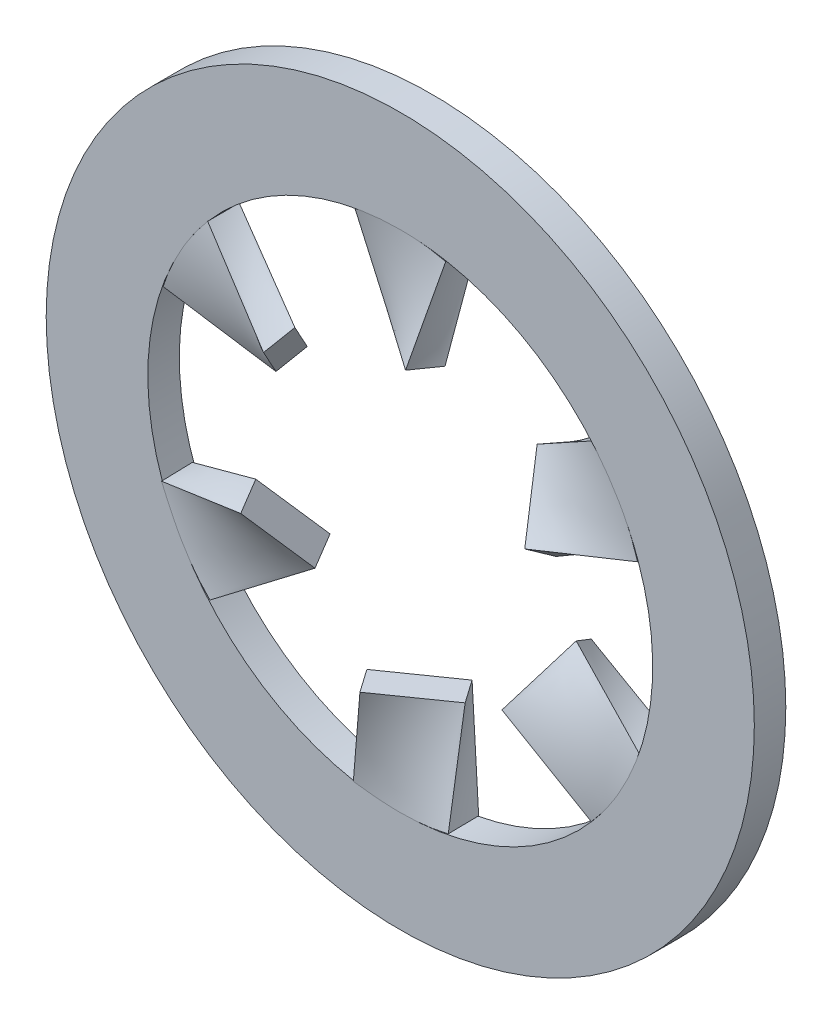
ISO-10303-21;
HEADER;
FILE_DESCRIPTION(('STEP AP214'),'2;1');
FILE_NAME('part.step','',(''),(''),'','','');
FILE_SCHEMA(('AUTOMOTIVE_DESIGN { 1 0 10303 214 1 1 1 1 }'));
ENDSEC;
DATA;
#1=APPLICATION_CONTEXT('core data for automotive mechanical design processes');
#2=APPLICATION_PROTOCOL_DEFINITION('international standard','automotive_design',2000,#1);
#3=PRODUCT_CONTEXT('',#1,'mechanical');
#4=PRODUCT('Part','Part','',(#3));
#5=PRODUCT_RELATED_PRODUCT_CATEGORY('part','',(#4));
#6=PRODUCT_DEFINITION_FORMATION('','',#4);
#7=PRODUCT_DEFINITION_CONTEXT('part definition',#1,'design');
#8=PRODUCT_DEFINITION('design','',#6,#7);
#9=PRODUCT_DEFINITION_SHAPE('','',#8);
#10=(LENGTH_UNIT() NAMED_UNIT(*) SI_UNIT(.MILLI.,.METRE.));
#11=(NAMED_UNIT(*) PLANE_ANGLE_UNIT() SI_UNIT($,.RADIAN.));
#12=(NAMED_UNIT(*) SI_UNIT($,.STERADIAN.) SOLID_ANGLE_UNIT());
#13=UNCERTAINTY_MEASURE_WITH_UNIT(LENGTH_MEASURE(1.E-05),#10,'distance_accuracy_value','');
#14=(GEOMETRIC_REPRESENTATION_CONTEXT(3) GLOBAL_UNCERTAINTY_ASSIGNED_CONTEXT((#13)) GLOBAL_UNIT_ASSIGNED_CONTEXT((#10,
#11,#12)) REPRESENTATION_CONTEXT('',''));
#15=CARTESIAN_POINT('',(0.,0.,0.));
#16=DIRECTION('',(0.,0.,1.));
#17=DIRECTION('',(1.,0.,0.));
#18=AXIS2_PLACEMENT_3D('',#15,#16,#17);
#19=CARTESIAN_POINT('',(0.,0.,0.1524));
#20=DIRECTION('',(0.,0.,-1.));
#21=DIRECTION('',(-1.,0.,0.));
#22=AXIS2_PLACEMENT_3D('',#19,#20,#21);
#23=CYLINDRICAL_SURFACE('',#22,2.44475);
#24=CARTESIAN_POINT('',(2.3073187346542,0.808135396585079,-0.141615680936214));
#25=CARTESIAN_POINT('',(2.28213638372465,0.880079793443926,-0.146731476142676));
#26=CARTESIAN_POINT('',(2.25354042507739,0.950895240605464,-0.14942932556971));
#27=CARTESIAN_POINT('',(2.18984401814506,1.08958140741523,-0.152264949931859));
#28=CARTESIAN_POINT('',(2.15474542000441,1.15745295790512,-0.152403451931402));
#29=CARTESIAN_POINT('',(2.07914673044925,1.28823098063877,-0.152396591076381));
#30=CARTESIAN_POINT('',(2.03877425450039,1.3512113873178,-0.152257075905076));
#31=CARTESIAN_POINT('',(1.95241636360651,1.4732545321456,-0.15389646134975));
#32=CARTESIAN_POINT('',(1.90642538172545,1.53231329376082,-0.155677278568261));
#33=CARTESIAN_POINT('',(1.85783016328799,1.58910970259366,-0.159517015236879));
#34=B_SPLINE_CURVE_WITH_KNOTS('',3,(#24,#25,#26,#27,#28,#29,#30,#31,#32,#33),.UNSPECIFIED.,.F.,
.F.,(4,2,2,2,4),(0.,0.228931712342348,0.457798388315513,0.681901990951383,0.906229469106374),.UNSPECIFIED.);
#35=CARTESIAN_POINT('',(2.1172187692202,1.2223695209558,-0.1524));
#36=VERTEX_POINT('',#35);
#37=CARTESIAN_POINT('',(2.3073187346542,0.808135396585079,-0.141615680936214));
#38=VERTEX_POINT('',#37);
#39=EDGE_CURVE('E13',#36,#38,#34,.F.);
#40=ORIENTED_EDGE('',*,*,#39,.F.);
#41=CARTESIAN_POINT('',(0.,0.,-0.1524));
#42=DIRECTION('',(0.,0.,1.));
#43=DIRECTION('',(1.,0.,0.));
#44=AXIS2_PLACEMENT_3D('',#41,#42,#43);
#45=CIRCLE('',#44,2.44475);
#46=CARTESIAN_POINT('',(2.30517503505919,-0.814230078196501,-0.1524));
#47=VERTEX_POINT('',#46);
#48=EDGE_CURVE('E749',#47,#36,#45,.T.);
#49=ORIENTED_EDGE('',*,*,#48,.F.);
#50=CARTESIAN_POINT('',(2.30731873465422,-0.808135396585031,0.141615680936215));
#51=CARTESIAN_POINT('',(2.30712887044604,-0.808677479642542,0.116222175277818));
#52=CARTESIAN_POINT('',(2.30694026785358,-0.809215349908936,0.0908285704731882));
#53=CARTESIAN_POINT('',(2.30656552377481,-0.810282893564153,0.0400411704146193));
#54=CARTESIAN_POINT('',(2.3063793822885,-0.810812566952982,0.0146473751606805));
#55=CARTESIAN_POINT('',(2.30583328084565,-0.812364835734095,-0.0603363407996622));
#56=CARTESIAN_POINT('',(2.30547669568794,-0.813376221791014,-0.109926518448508));
#57=CARTESIAN_POINT('',(2.30512445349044,-0.814373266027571,-0.159517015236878));
#58=B_SPLINE_CURVE_WITH_KNOTS('',3,(#50,#51,#52,#53,#54,#55,#56,#57),.UNSPECIFIED.,.F.,.F.,(4,2,
2,4),(0.,0.0762000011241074,0.152400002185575,0.301205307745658),.UNSPECIFIED.);
#59=CARTESIAN_POINT('',(2.30731873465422,-0.80813539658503,0.141615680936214));
#60=VERTEX_POINT('',#59);
#61=EDGE_CURVE('E380',#60,#47,#58,.T.);
#62=ORIENTED_EDGE('',*,*,#61,.F.);
#63=CARTESIAN_POINT('',(2.30731873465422,-0.808135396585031,0.141615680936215));
#64=CARTESIAN_POINT('',(2.28213638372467,-0.880079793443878,0.146731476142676));
#65=CARTESIAN_POINT('',(2.25354042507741,-0.950895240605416,0.14942932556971));
#66=CARTESIAN_POINT('',(2.18984401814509,-1.08958140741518,0.152264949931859));
#67=CARTESIAN_POINT('',(2.15474542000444,-1.15745295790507,0.152403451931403));
#68=CARTESIAN_POINT('',(2.07914673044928,-1.28823098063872,0.152396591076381));
#69=CARTESIAN_POINT('',(2.03877425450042,-1.35121138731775,0.152257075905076));
#70=CARTESIAN_POINT('',(1.95241636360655,-1.47325453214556,0.15389646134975));
#71=CARTESIAN_POINT('',(1.90642538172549,-1.53231329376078,0.155677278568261));
#72=CARTESIAN_POINT('',(1.85783016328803,-1.58910970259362,0.159517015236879));
#73=B_SPLINE_CURVE_WITH_KNOTS('',3,(#63,#64,#65,#66,#67,#68,#69,#70,#71,#72),.UNSPECIFIED.,.F.,
.F.,(4,2,2,2,4),(0.,0.228931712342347,0.457798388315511,0.681901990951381,0.906229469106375),.UNSPECIFIED.);
#74=CARTESIAN_POINT('',(2.11721876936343,-1.22236952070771,0.1524));
#75=VERTEX_POINT('',#74);
#76=EDGE_CURVE('E1818',#75,#60,#73,.F.);
#77=ORIENTED_EDGE('',*,*,#76,.F.);
#78=CARTESIAN_POINT('',(0.,0.,0.1524));
#79=DIRECTION('',(0.,0.,1.));
#80=DIRECTION('',(1.,0.,0.));
#81=AXIS2_PLACEMENT_3D('',#78,#79,#80);
#82=CIRCLE('',#81,2.44475);
#83=CARTESIAN_POINT('',(2.30517503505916,0.814230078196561,0.1524));
#84=VERTEX_POINT('',#83);
#85=EDGE_CURVE('E2003',#75,#84,#82,.T.);
#86=ORIENTED_EDGE('',*,*,#85,.T.);
#87=CARTESIAN_POINT('',(2.3073187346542,0.808135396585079,-0.141615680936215));
#88=CARTESIAN_POINT('',(2.30712887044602,0.80867747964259,-0.116222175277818));
#89=CARTESIAN_POINT('',(2.30694026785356,0.809215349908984,-0.0908285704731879));
#90=CARTESIAN_POINT('',(2.30656552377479,0.810282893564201,-0.040041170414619));
#91=CARTESIAN_POINT('',(2.30637938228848,0.81081256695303,-0.0146473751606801));
#92=CARTESIAN_POINT('',(2.30583328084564,0.812364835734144,0.0603363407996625));
#93=CARTESIAN_POINT('',(2.30547669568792,0.813376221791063,0.109926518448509));
#94=CARTESIAN_POINT('',(2.30512445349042,0.814373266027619,0.159517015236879));
#95=B_SPLINE_CURVE_WITH_KNOTS('',3,(#87,#88,#89,#90,#91,#92,#93,#94),.UNSPECIFIED.,.F.,.F.,(4,2,
2,4),(0.,0.0762000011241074,0.152400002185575,0.301205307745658),.UNSPECIFIED.);
#96=EDGE_CURVE('E63',#38,#84,#95,.T.);
#97=ORIENTED_EDGE('',*,*,#96,.F.);
#98=EDGE_LOOP('',(#40,#49,#62,#77,#86,#97));
#99=FACE_BOUND('',#98,.T.);
#100=ADVANCED_FACE('F45',(#99),#23,.F.);
#101=CARTESIAN_POINT('',(1.85352515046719,-1.59412894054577,-0.141615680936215));
#102=CARTESIAN_POINT('',(1.90323965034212,-1.53634818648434,-0.146731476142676));
#103=CARTESIAN_POINT('',(1.95026964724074,-1.47617563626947,-0.14942932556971));
#104=CARTESIAN_POINT('',(2.03852718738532,-1.35166984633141,-0.152264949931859));
#105=CARTESIAN_POINT('',(2.07975637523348,-1.28733779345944,-0.152403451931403));
#106=CARTESIAN_POINT('',(2.15521412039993,-1.15647839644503,-0.152396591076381));
#107=CARTESIAN_POINT('',(2.18957051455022,-1.09002460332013,-0.152257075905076));
#108=CARTESIAN_POINT('',(2.25208403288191,-0.954214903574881,-0.15389646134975));
#109=CARTESIAN_POINT('',(2.2802349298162,-0.884856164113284,-0.155677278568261));
#110=CARTESIAN_POINT('',(2.30512445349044,-0.81437326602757,-0.159517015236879));
#111=B_SPLINE_CURVE_WITH_KNOTS('',3,(#101,#102,#103,#104,#105,#106,#107,#108,#109,#110),
.UNSPECIFIED.,.F.,.F.,(4,2,2,2,4),(0.,0.228931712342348,0.457798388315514,0.681901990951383,
0.906229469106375),.UNSPECIFIED.);
#112=CARTESIAN_POINT('',(2.11721244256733,-1.22238047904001,-0.1524));
#113=VERTEX_POINT('',#112);
#114=CARTESIAN_POINT('',(1.85352515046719,-1.59412894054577,-0.141615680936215));
#115=VERTEX_POINT('',#114);
#116=EDGE_CURVE('E611',#113,#115,#111,.F.);
#117=ORIENTED_EDGE('',*,*,#116,.F.);
#118=CARTESIAN_POINT('',(0.447443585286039,-2.40345517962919,-0.1524));
#119=VERTEX_POINT('',#118);
#120=EDGE_CURVE('E609',#119,#113,#45,.T.);
#121=ORIENTED_EDGE('',*,*,#120,.F.);
#122=CARTESIAN_POINT('',(0.453793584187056,-2.40226433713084,0.141615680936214));
#123=CARTESIAN_POINT('',(0.453229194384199,-2.40237095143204,0.116222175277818));
#124=CARTESIAN_POINT('',(0.45266908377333,-2.40247655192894,0.0908285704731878));
#125=CARTESIAN_POINT('',(0.45155719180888,-2.40268578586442,0.040041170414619));
#126=CARTESIAN_POINT('',(0.451005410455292,-2.40278941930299,0.0146473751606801));
#127=CARTESIAN_POINT('',(0.449388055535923,-2.403092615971,-0.0603363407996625));
#128=CARTESIAN_POINT('',(0.448333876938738,-2.40328949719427,-0.109926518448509));
#129=CARTESIAN_POINT('',(0.447294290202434,-2.40348296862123,-0.159517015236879));
#130=B_SPLINE_CURVE_WITH_KNOTS('',3,(#122,#123,#124,#125,#126,#127,#128,#129),.UNSPECIFIED.,.F.,
.F.,(4,2,2,4),(0.,0.0762000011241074,0.152400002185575,0.301205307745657),.UNSPECIFIED.);
#131=CARTESIAN_POINT('',(0.453793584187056,-2.40226433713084,0.141615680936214));
#132=VERTEX_POINT('',#131);
#133=EDGE_CURVE('E453',#132,#119,#130,.T.);
#134=ORIENTED_EDGE('',*,*,#133,.F.);
#135=CARTESIAN_POINT('',(0.453793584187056,-2.40226433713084,0.141615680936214));
#136=CARTESIAN_POINT('',(0.37889673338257,-2.41642797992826,0.146731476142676));
#137=CARTESIAN_POINT('',(0.303270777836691,-2.42707087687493,0.14942932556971));
#138=CARTESIAN_POINT('',(0.151316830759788,-2.44125125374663,0.152264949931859));
#139=CARTESIAN_POINT('',(0.0749890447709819,-2.44479075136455,0.152403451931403));
#140=CARTESIAN_POINT('',(-0.0760673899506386,-2.44470937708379,0.152396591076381));
#141=CARTESIAN_POINT('',(-0.150796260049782,-2.44123599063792,0.152257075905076));
#142=CARTESIAN_POINT('',(-0.299667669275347,-2.42746943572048,0.15389646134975));
#143=CARTESIAN_POINT('',(-0.373809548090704,-2.4171694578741,0.155677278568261));
#144=CARTESIAN_POINT('',(-0.447294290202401,-2.40348296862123,0.159517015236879));
#145=B_SPLINE_CURVE_WITH_KNOTS('',3,(#135,#136,#137,#138,#139,#140,#141,#142,#143,#144),
.UNSPECIFIED.,.F.,.F.,(4,2,2,2,4),(0.,0.228931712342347,0.457798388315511,0.681901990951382,
0.906229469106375),.UNSPECIFIED.);
#146=CARTESIAN_POINT('',(6.32723341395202E-06,-2.44474999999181,0.1524));
#147=VERTEX_POINT('',#146);
#148=EDGE_CURVE('E1823',#147,#132,#145,.F.);
#149=ORIENTED_EDGE('',*,*,#148,.F.);
#150=CARTESIAN_POINT('',(1.8577314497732,-1.58922510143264,0.1524));
#151=VERTEX_POINT('',#150);
#152=EDGE_CURVE('E2001',#147,#151,#82,.T.);
#153=ORIENTED_EDGE('',*,*,#152,.T.);
#154=CARTESIAN_POINT('',(1.85352515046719,-1.59412894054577,-0.141615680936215));
#155=CARTESIAN_POINT('',(1.85389967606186,-1.59369347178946,-0.116222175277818));
#156=CARTESIAN_POINT('',(1.85427118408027,-1.59326120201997,-0.0908285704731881));
#157=CARTESIAN_POINT('',(1.85500833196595,-1.59240289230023,-0.0400411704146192));
#158=CARTESIAN_POINT('',(1.85537397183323,-1.59197685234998,-0.0146473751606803));
#159=CARTESIAN_POINT('',(1.85644522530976,-1.59072778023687,0.0603363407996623));
#160=CARTESIAN_POINT('',(1.85714281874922,-1.58991327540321,0.109926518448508));
#161=CARTESIAN_POINT('',(1.85783016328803,-1.58910970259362,0.159517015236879));
#162=B_SPLINE_CURVE_WITH_KNOTS('',3,(#154,#155,#156,#157,#158,#159,#160,#161),.UNSPECIFIED.,.F.,
.F.,(4,2,2,4),(0.,0.0762000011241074,0.152400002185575,0.301205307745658),.UNSPECIFIED.);
#163=EDGE_CURVE('E390',#115,#151,#162,.T.);
#164=ORIENTED_EDGE('',*,*,#163,.F.);
#165=EDGE_LOOP('',(#117,#121,#134,#149,#153,#164));
#166=FACE_BOUND('',#165,.T.);
#167=ADVANCED_FACE('F505',(#166),#23,.F.);
#168=CARTESIAN_POINT('',(-0.453793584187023,-2.40226433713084,-0.141615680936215));
#169=CARTESIAN_POINT('',(-0.378896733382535,-2.41642797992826,-0.146731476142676));
#170=CARTESIAN_POINT('',(-0.303270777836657,-2.42707087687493,-0.14942932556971));
#171=CARTESIAN_POINT('',(-0.151316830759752,-2.44125125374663,-0.152264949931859));
#172=CARTESIAN_POINT('',(-0.0749890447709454,-2.44479075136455,-0.152403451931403));
#173=CARTESIAN_POINT('',(0.0760673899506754,-2.44470937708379,-0.152396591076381));
#174=CARTESIAN_POINT('',(0.150796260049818,-2.44123599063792,-0.152257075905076));
#175=CARTESIAN_POINT('',(0.299667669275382,-2.42746943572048,-0.15389646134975));
#176=CARTESIAN_POINT('',(0.373809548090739,-2.4171694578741,-0.155677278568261));
#177=CARTESIAN_POINT('',(0.447294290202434,-2.40348296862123,-0.159517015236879));
#178=B_SPLINE_CURVE_WITH_KNOTS('',3,(#168,#169,#170,#171,#172,#173,#174,#175,#176,#177),
.UNSPECIFIED.,.F.,.F.,(4,2,2,2,4),(0.,0.228931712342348,0.457798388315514,0.681901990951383,
0.906229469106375),.UNSPECIFIED.);
#179=CARTESIAN_POINT('',(-6.32638500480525E-06,-2.44474999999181,-0.1524));
#180=VERTEX_POINT('',#179);
#181=CARTESIAN_POINT('',(-0.453793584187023,-2.40226433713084,-0.141615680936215));
#182=VERTEX_POINT('',#181);
#183=EDGE_CURVE('E1821',#180,#182,#178,.F.);
#184=ORIENTED_EDGE('',*,*,#183,.F.);
#185=CARTESIAN_POINT('',(-1.85773144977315,-1.58922510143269,-0.1524));
#186=VERTEX_POINT('',#185);
#187=EDGE_CURVE('E1741',#186,#180,#45,.T.);
#188=ORIENTED_EDGE('',*,*,#187,.F.);
#189=CARTESIAN_POINT('',(-1.85352515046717,-1.5941289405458,0.141615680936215));
#190=CARTESIAN_POINT('',(-1.85389967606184,-1.59369347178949,0.116222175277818));
#191=CARTESIAN_POINT('',(-1.85427118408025,-1.59326120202,0.090828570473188));
#192=CARTESIAN_POINT('',(-1.85500833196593,-1.59240289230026,0.0400411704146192));
#193=CARTESIAN_POINT('',(-1.85537397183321,-1.59197685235,0.0146473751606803));
#194=CARTESIAN_POINT('',(-1.85644522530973,-1.5907277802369,-0.0603363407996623));
#195=CARTESIAN_POINT('',(-1.8571428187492,-1.58991327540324,-0.109926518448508));
#196=CARTESIAN_POINT('',(-1.857830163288,-1.58910970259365,-0.159517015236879));
#197=B_SPLINE_CURVE_WITH_KNOTS('',3,(#189,#190,#191,#192,#193,#194,#195,#196),.UNSPECIFIED.,.F.,
.F.,(4,2,2,4),(0.,0.0762000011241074,0.152400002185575,0.301205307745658),.UNSPECIFIED.);
#198=CARTESIAN_POINT('',(-1.85352515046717,-1.5941289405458,0.141615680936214));
#199=VERTEX_POINT('',#198);
#200=EDGE_CURVE('E1588',#199,#186,#197,.T.);
#201=ORIENTED_EDGE('',*,*,#200,.F.);
#202=CARTESIAN_POINT('',(-1.85352515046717,-1.5941289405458,0.141615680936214));
#203=CARTESIAN_POINT('',(-1.9032396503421,-1.53634818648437,0.146731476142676));
#204=CARTESIAN_POINT('',(-1.95026964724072,-1.4761756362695,0.14942932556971));
#205=CARTESIAN_POINT('',(-2.0385271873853,-1.35166984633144,0.152264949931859));
#206=CARTESIAN_POINT('',(-2.07975637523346,-1.28733779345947,0.152403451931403));
#207=CARTESIAN_POINT('',(-2.15521412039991,-1.15647839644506,0.152396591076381));
#208=CARTESIAN_POINT('',(-2.18957051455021,-1.09002460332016,0.152257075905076));
#209=CARTESIAN_POINT('',(-2.25208403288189,-0.954214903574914,0.15389646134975));
#210=CARTESIAN_POINT('',(-2.28023492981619,-0.884856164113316,0.155677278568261));
#211=CARTESIAN_POINT('',(-2.30512445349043,-0.814373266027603,0.159517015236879));
#212=B_SPLINE_CURVE_WITH_KNOTS('',3,(#202,#203,#204,#205,#206,#207,#208,#209,#210,#211),
.UNSPECIFIED.,.F.,.F.,(4,2,2,2,4),(0.,0.228931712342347,0.457798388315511,0.681901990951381,
0.906229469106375),.UNSPECIFIED.);
#213=CARTESIAN_POINT('',(-2.11721244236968,-1.22238047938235,0.1524));
#214=VERTEX_POINT('',#213);
#215=EDGE_CURVE('E555',#214,#199,#212,.F.);
#216=ORIENTED_EDGE('',*,*,#215,.F.);
#217=CARTESIAN_POINT('',(-0.447443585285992,-2.4034551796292,0.1524));
#218=VERTEX_POINT('',#217);
#219=EDGE_CURVE('E2002',#214,#218,#82,.T.);
#220=ORIENTED_EDGE('',*,*,#219,.T.);
#221=CARTESIAN_POINT('',(-0.453793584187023,-2.40226433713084,-0.141615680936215));
#222=CARTESIAN_POINT('',(-0.453229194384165,-2.40237095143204,-0.116222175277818));
#223=CARTESIAN_POINT('',(-0.452669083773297,-2.40247655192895,-0.090828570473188));
#224=CARTESIAN_POINT('',(-0.451557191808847,-2.40268578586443,-0.0400411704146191));
#225=CARTESIAN_POINT('',(-0.451005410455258,-2.402789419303,-0.0146473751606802));
#226=CARTESIAN_POINT('',(-0.449388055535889,-2.40309261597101,0.0603363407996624));
#227=CARTESIAN_POINT('',(-0.448333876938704,-2.40328949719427,0.109926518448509));
#228=CARTESIAN_POINT('',(-0.447294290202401,-2.40348296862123,0.159517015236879));
#229=B_SPLINE_CURVE_WITH_KNOTS('',3,(#221,#222,#223,#224,#225,#226,#227,#228),.UNSPECIFIED.,.F.,
.F.,(4,2,2,4),(0.,0.0762000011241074,0.152400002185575,0.301205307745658),.UNSPECIFIED.);
#230=EDGE_CURVE('E1980',#182,#218,#229,.T.);
#231=ORIENTED_EDGE('',*,*,#230,.F.);
#232=EDGE_LOOP('',(#184,#188,#201,#216,#220,#231));
#233=FACE_BOUND('',#232,.T.);
#234=ADVANCED_FACE('F511',(#233),#23,.F.);
#235=CARTESIAN_POINT('',(-2.30731873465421,-0.808135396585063,-0.141615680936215));
#236=CARTESIAN_POINT('',(-2.28213638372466,-0.88007979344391,-0.146731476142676));
#237=CARTESIAN_POINT('',(-2.25354042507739,-0.950895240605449,-0.14942932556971));
#238=CARTESIAN_POINT('',(-2.18984401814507,-1.08958140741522,-0.152264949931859));
#239=CARTESIAN_POINT('',(-2.15474542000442,-1.1574529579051,-0.152403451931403));
#240=CARTESIAN_POINT('',(-2.07914673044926,-1.28823098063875,-0.152396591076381));
#241=CARTESIAN_POINT('',(-2.0387742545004,-1.35121138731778,-0.152257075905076));
#242=CARTESIAN_POINT('',(-1.95241636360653,-1.47325453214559,-0.15389646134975));
#243=CARTESIAN_POINT('',(-1.90642538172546,-1.53231329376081,-0.155677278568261));
#244=CARTESIAN_POINT('',(-1.857830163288,-1.58910970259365,-0.159517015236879));
#245=B_SPLINE_CURVE_WITH_KNOTS('',3,(#235,#236,#237,#238,#239,#240,#241,#242,#243,#244),
.UNSPECIFIED.,.F.,.F.,(4,2,2,2,4),(0.,0.228931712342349,0.457798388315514,0.681901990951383,
0.906229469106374),.UNSPECIFIED.);
#246=CARTESIAN_POINT('',(-2.1172187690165,-1.22236952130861,-0.1524));
#247=VERTEX_POINT('',#246);
#248=CARTESIAN_POINT('',(-2.30731873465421,-0.808135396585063,-0.141615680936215));
#249=VERTEX_POINT('',#248);
#250=EDGE_CURVE('E1739',#247,#249,#245,.F.);
#251=ORIENTED_EDGE('',*,*,#250,.F.);
#252=CARTESIAN_POINT('',(-2.30517503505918,0.814230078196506,-0.1524));
#253=VERTEX_POINT('',#252);
#254=EDGE_CURVE('E572',#253,#247,#45,.T.);
#255=ORIENTED_EDGE('',*,*,#254,.F.);
#256=CARTESIAN_POINT('',(-2.30731873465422,0.808135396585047,0.141615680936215));
#257=CARTESIAN_POINT('',(-2.30712887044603,0.808677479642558,0.116222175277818));
#258=CARTESIAN_POINT('',(-2.30694026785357,0.809215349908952,0.0908285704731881));
#259=CARTESIAN_POINT('',(-2.3065655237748,0.810282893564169,0.0400411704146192));
#260=CARTESIAN_POINT('',(-2.3063793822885,0.810812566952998,0.0146473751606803));
#261=CARTESIAN_POINT('',(-2.30583328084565,0.812364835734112,-0.0603363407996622));
#262=CARTESIAN_POINT('',(-2.30547669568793,0.813376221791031,-0.109926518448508));
#263=CARTESIAN_POINT('',(-2.30512445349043,0.814373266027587,-0.159517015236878));
#264=B_SPLINE_CURVE_WITH_KNOTS('',3,(#256,#257,#258,#259,#260,#261,#262,#263),.UNSPECIFIED.,.F.,
.F.,(4,2,2,4),(0.,0.0762000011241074,0.152400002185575,0.301205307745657),.UNSPECIFIED.);
#265=CARTESIAN_POINT('',(-2.30731873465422,0.808135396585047,0.141615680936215));
#266=VERTEX_POINT('',#265);
#267=EDGE_CURVE('E798',#266,#253,#264,.T.);
#268=ORIENTED_EDGE('',*,*,#267,.F.);
#269=CARTESIAN_POINT('',(-2.30731873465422,0.808135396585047,0.141615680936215));
#270=CARTESIAN_POINT('',(-2.28213638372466,0.880079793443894,0.146731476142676));
#271=CARTESIAN_POINT('',(-2.2535404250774,0.950895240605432,0.14942932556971));
#272=CARTESIAN_POINT('',(-2.18984401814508,1.0895814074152,0.152264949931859));
#273=CARTESIAN_POINT('',(-2.15474542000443,1.15745295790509,0.152403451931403));
#274=CARTESIAN_POINT('',(-2.07914673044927,1.28823098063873,0.152396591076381));
#275=CARTESIAN_POINT('',(-2.03877425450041,1.35121138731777,0.152257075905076));
#276=CARTESIAN_POINT('',(-1.95241636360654,1.47325453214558,0.15389646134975));
#277=CARTESIAN_POINT('',(-1.90642538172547,1.53231329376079,0.155677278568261));
#278=CARTESIAN_POINT('',(-1.85783016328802,1.58910970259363,0.159517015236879));
#279=B_SPLINE_CURVE_WITH_KNOTS('',3,(#269,#270,#271,#272,#273,#274,#275,#276,#277,#278),
.UNSPECIFIED.,.F.,.F.,(4,2,2,2,4),(0.,0.228931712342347,0.457798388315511,0.681901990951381,
0.906229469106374),.UNSPECIFIED.);
#280=CARTESIAN_POINT('',(-2.11721876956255,1.22236952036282,0.1524));
#281=VERTEX_POINT('',#280);
#282=EDGE_CURVE('E556',#281,#266,#279,.F.);
#283=ORIENTED_EDGE('',*,*,#282,.F.);
#284=CARTESIAN_POINT('',(-2.30517503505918,-0.814230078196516,0.1524));
#285=VERTEX_POINT('',#284);
#286=EDGE_CURVE('E2028',#281,#285,#82,.T.);
#287=ORIENTED_EDGE('',*,*,#286,.T.);
#288=CARTESIAN_POINT('',(-2.30731873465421,-0.808135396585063,-0.141615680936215));
#289=CARTESIAN_POINT('',(-2.30712887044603,-0.808677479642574,-0.116222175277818));
#290=CARTESIAN_POINT('',(-2.30694026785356,-0.809215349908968,-0.090828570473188));
#291=CARTESIAN_POINT('',(-2.3065655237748,-0.810282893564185,-0.0400411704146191));
#292=CARTESIAN_POINT('',(-2.30637938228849,-0.810812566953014,-0.0146473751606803));
#293=CARTESIAN_POINT('',(-2.30583328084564,-0.812364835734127,0.0603363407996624));
#294=CARTESIAN_POINT('',(-2.30547669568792,-0.813376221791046,0.109926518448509));
#295=CARTESIAN_POINT('',(-2.30512445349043,-0.814373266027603,0.159517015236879));
#296=B_SPLINE_CURVE_WITH_KNOTS('',3,(#288,#289,#290,#291,#292,#293,#294,#295),.UNSPECIFIED.,.F.,
.F.,(4,2,2,4),(0.,0.0762000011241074,0.152400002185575,0.301205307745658),.UNSPECIFIED.);
#297=EDGE_CURVE('E1595',#249,#285,#296,.T.);
#298=ORIENTED_EDGE('',*,*,#297,.F.);
#299=EDGE_LOOP('',(#251,#255,#268,#283,#287,#298));
#300=FACE_BOUND('',#299,.T.);
#301=ADVANCED_FACE('F533',(#300),#23,.F.);
#302=CARTESIAN_POINT('',(-1.85352515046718,1.59412894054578,-0.141615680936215));
#303=CARTESIAN_POINT('',(-1.90323965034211,1.53634818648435,-0.146731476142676));
#304=CARTESIAN_POINT('',(-1.95026964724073,1.47617563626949,-0.14942932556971));
#305=CARTESIAN_POINT('',(-2.03852718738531,1.35166984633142,-0.152264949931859));
#306=CARTESIAN_POINT('',(-2.07975637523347,1.28733779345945,-0.152403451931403));
#307=CARTESIAN_POINT('',(-2.15521412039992,1.15647839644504,-0.152396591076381));
#308=CARTESIAN_POINT('',(-2.18957051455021,1.09002460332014,-0.152257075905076));
#309=CARTESIAN_POINT('',(-2.2520840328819,0.954214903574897,-0.15389646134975));
#310=CARTESIAN_POINT('',(-2.28023492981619,0.8848561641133,-0.155677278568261));
#311=CARTESIAN_POINT('',(-2.30512445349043,0.814373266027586,-0.159517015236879));
#312=B_SPLINE_CURVE_WITH_KNOTS('',3,(#302,#303,#304,#305,#306,#307,#308,#309,#310,#311),
.UNSPECIFIED.,.F.,.F.,(4,2,2,2,4),(0.,0.228931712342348,0.457798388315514,0.681901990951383,
0.906229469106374),.UNSPECIFIED.);
#313=CARTESIAN_POINT('',(-2.11721244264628,1.22238047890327,-0.1524));
#314=VERTEX_POINT('',#313);
#315=CARTESIAN_POINT('',(-1.85352515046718,1.59412894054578,-0.141615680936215));
#316=VERTEX_POINT('',#315);
#317=EDGE_CURVE('E545',#314,#316,#312,.F.);
#318=ORIENTED_EDGE('',*,*,#317,.F.);
#319=CARTESIAN_POINT('',(-0.44744358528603,2.40345517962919,-0.1524));
#320=VERTEX_POINT('',#319);
#321=EDGE_CURVE('E547',#320,#314,#45,.T.);
#322=ORIENTED_EDGE('',*,*,#321,.F.);
#323=CARTESIAN_POINT('',(-0.45379358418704,2.40226433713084,0.141615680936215));
#324=CARTESIAN_POINT('',(-0.453229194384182,2.40237095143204,0.116222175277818));
#325=CARTESIAN_POINT('',(-0.452669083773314,2.40247655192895,0.0908285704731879));
#326=CARTESIAN_POINT('',(-0.451557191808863,2.40268578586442,0.0400411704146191));
#327=CARTESIAN_POINT('',(-0.451005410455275,2.402789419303,0.0146473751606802));
#328=CARTESIAN_POINT('',(-0.449388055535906,2.40309261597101,-0.0603363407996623));
#329=CARTESIAN_POINT('',(-0.448333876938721,2.40328949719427,-0.109926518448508));
#330=CARTESIAN_POINT('',(-0.447294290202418,2.40348296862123,-0.159517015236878));
#331=B_SPLINE_CURVE_WITH_KNOTS('',3,(#323,#324,#325,#326,#327,#328,#329,#330),.UNSPECIFIED.,.F.,
.F.,(4,2,2,4),(0.,0.0762000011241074,0.152400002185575,0.301205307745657),.UNSPECIFIED.);
#332=CARTESIAN_POINT('',(-0.45379358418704,2.40226433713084,0.141615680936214));
#333=VERTEX_POINT('',#332);
#334=EDGE_CURVE('E993',#333,#320,#331,.T.);
#335=ORIENTED_EDGE('',*,*,#334,.F.);
#336=CARTESIAN_POINT('',(0.447294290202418,2.40348296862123,0.159517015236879));
#337=CARTESIAN_POINT('',(0.372306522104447,2.41745042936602,0.155599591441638));
#338=CARTESIAN_POINT('',(0.296633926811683,2.42789001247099,0.153825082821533));
#339=CARTESIAN_POINT('',(0.14463218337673,2.4416576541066,0.152230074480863));
#340=CARTESIAN_POINT('',(0.0683031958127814,2.44498740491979,0.152409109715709));
#341=CARTESIAN_POINT('',(-0.0827389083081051,2.44449155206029,0.152389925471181));
#342=CARTESIAN_POINT('',(-0.157452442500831,2.44081409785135,0.152199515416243));
#343=CARTESIAN_POINT('',(-0.306276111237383,2.42664582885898,0.149321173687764));
#344=CARTESIAN_POINT('',(-0.380385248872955,2.41614543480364,0.146629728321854));
#345=CARTESIAN_POINT('',(-0.45379358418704,2.40226433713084,0.141615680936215));
#346=B_SPLINE_CURVE_WITH_KNOTS('',3,(#336,#337,#338,#339,#340,#341,#342,#343,#344,#345),
.UNSPECIFIED.,.F.,.F.,(4,2,2,2,4),(0.,0.228911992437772,0.457769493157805,0.681842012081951,
0.906229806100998),.UNSPECIFIED.);
#347=CARTESIAN_POINT('',(3.49348402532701E-12,2.44475,0.1524));
#348=VERTEX_POINT('',#347);
#349=EDGE_CURVE('E954',#348,#333,#346,.T.);
#350=ORIENTED_EDGE('',*,*,#349,.F.);
#351=CARTESIAN_POINT('',(-1.85773144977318,1.58922510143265,0.1524));
#352=VERTEX_POINT('',#351);
#353=EDGE_CURVE('E1160',#348,#352,#82,.T.);
#354=ORIENTED_EDGE('',*,*,#353,.T.);
#355=CARTESIAN_POINT('',(-1.85352515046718,1.59412894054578,-0.141615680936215));
#356=CARTESIAN_POINT('',(-1.85389967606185,1.59369347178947,-0.116222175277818));
#357=CARTESIAN_POINT('',(-1.85427118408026,1.59326120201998,-0.0908285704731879));
#358=CARTESIAN_POINT('',(-1.85500833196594,1.59240289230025,-0.040041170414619));
#359=CARTESIAN_POINT('',(-1.85537397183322,1.59197685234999,-0.0146473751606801));
#360=CARTESIAN_POINT('',(-1.85644522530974,1.59072778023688,0.0603363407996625));
#361=CARTESIAN_POINT('',(-1.85714281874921,1.58991327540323,0.109926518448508));
#362=CARTESIAN_POINT('',(-1.85783016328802,1.58910970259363,0.159517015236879));
#363=B_SPLINE_CURVE_WITH_KNOTS('',3,(#355,#356,#357,#358,#359,#360,#361,#362),.UNSPECIFIED.,.F.,
.F.,(4,2,2,4),(0.,0.0762000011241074,0.152400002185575,0.301205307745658),.UNSPECIFIED.);
#364=EDGE_CURVE('E551',#316,#352,#363,.T.);
#365=ORIENTED_EDGE('',*,*,#364,.F.);
#366=EDGE_LOOP('',(#318,#322,#335,#350,#354,#365));
#367=FACE_BOUND('',#366,.T.);
#368=ADVANCED_FACE('F519',(#367),#23,.F.);
#369=CARTESIAN_POINT('',(0.,0.,-0.322246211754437));
#370=DIRECTION('',(0.,0.,1.));
#371=DIRECTION('',(1.,0.,0.));
#372=AXIS2_PLACEMENT_3D('',#369,#370,#371);
#373=CYLINDRICAL_SURFACE('',#372,2.44475);
#374=CARTESIAN_POINT('',(-0.447294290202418,2.40348296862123,-0.159517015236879));
#375=VERTEX_POINT('',#374);
#376=EDGE_CURVE('E1162',#320,#375,#331,.T.);
#377=ORIENTED_EDGE('',*,*,#376,.F.);
#378=CARTESIAN_POINT('',(0.,0.,-0.1524));
#379=DIRECTION('',(0.,0.,1.));
#380=DIRECTION('',(1.,0.,0.));
#381=AXIS2_PLACEMENT_3D('',#378,#379,#380);
#382=CIRCLE('',#381,2.44475);
#383=CARTESIAN_POINT('',(-0.0870991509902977,2.44319796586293,-0.1524));
#384=VERTEX_POINT('',#383);
#385=EDGE_CURVE('E563',#320,#384,#382,.F.);
#386=ORIENTED_EDGE('',*,*,#385,.T.);
#387=CARTESIAN_POINT('',(-0.447294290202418,2.40348296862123,-0.159517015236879));
#388=CARTESIAN_POINT('',(-0.372306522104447,2.41745042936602,-0.155599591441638));
#389=CARTESIAN_POINT('',(-0.296633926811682,2.42789001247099,-0.153825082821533));
#390=CARTESIAN_POINT('',(-0.144632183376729,2.4416576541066,-0.152230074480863));
#391=CARTESIAN_POINT('',(-0.0683031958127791,2.44498740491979,-0.152409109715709));
#392=CARTESIAN_POINT('',(0.0827389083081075,2.44449155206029,-0.152389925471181));
#393=CARTESIAN_POINT('',(0.157452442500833,2.44081409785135,-0.152199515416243));
#394=CARTESIAN_POINT('',(0.306276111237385,2.42664582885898,-0.149321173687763));
#395=CARTESIAN_POINT('',(0.380385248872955,2.41614543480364,-0.146629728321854));
#396=CARTESIAN_POINT('',(0.45379358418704,2.40226433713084,-0.141615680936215));
#397=B_SPLINE_CURVE_WITH_KNOTS('',3,(#387,#388,#389,#390,#391,#392,#393,#394,#395,#396),
.UNSPECIFIED.,.F.,.F.,(4,2,2,2,4),(0.,0.228911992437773,0.457769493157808,0.681842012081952,
0.906229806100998),.UNSPECIFIED.);
#398=EDGE_CURVE('E1008',#375,#384,#397,.T.);
#399=ORIENTED_EDGE('',*,*,#398,.F.);
#400=EDGE_LOOP('',(#377,#386,#399));
#401=FACE_BOUND('',#400,.T.);
#402=ADVANCED_FACE('F532',(#401),#373,.T.);
#403=CARTESIAN_POINT('',(-0.4572,2.44475,-0.1524));
#404=CARTESIAN_POINT('',(-0.220941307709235,1.4605,-0.322146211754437));
#405=CARTESIAN_POINT('',(-0.304799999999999,2.44475,-0.1524));
#406=CARTESIAN_POINT('',(-0.121070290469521,1.4605,-0.252215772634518));
#407=CARTESIAN_POINT('',(-0.152399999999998,2.44475,-0.1524));
#408=CARTESIAN_POINT('',(-0.0211992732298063,1.4605,-0.182285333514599));
#409=CARTESIAN_POINT('',(0.152400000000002,2.44475,-0.1524));
#410=CARTESIAN_POINT('',(0.178542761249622,1.4605,-0.0424244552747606));
#411=CARTESIAN_POINT('',(0.304800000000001,2.44475,-0.1524));
#412=CARTESIAN_POINT('',(0.278413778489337,1.4605,0.0275059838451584));
#413=CARTESIAN_POINT('',(0.4572,2.44475,-0.1524));
#414=CARTESIAN_POINT('',(0.378284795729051,1.4605,0.0974364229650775));
#415=B_SPLINE_SURFACE_WITH_KNOTS('',3,1,((#403,#404),(#405,#406),(#407,#408),(#409,#410),(#411,
#412),(#413,#414)),.UNSPECIFIED.,.F.,.F.,.F.,(4,2,4),(2,2),(0.,0.5,1.),(0.,1.),.UNSPECIFIED.);
#416=DIRECTION('',(-0.230194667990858,0.958987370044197,0.165389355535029));
#417=VECTOR('',#416,1.);
#418=CARTESIAN_POINT('',(-0.339070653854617,1.952625,-0.237273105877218));
#419=LINE('',#418,#417);
#420=CARTESIAN_POINT('',(-0.220941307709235,1.4605,-0.322146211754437));
#421=VERTEX_POINT('',#420);
#422=EDGE_CURVE('E1123',#421,#375,#419,.T.);
#423=CARTESIAN_POINT('',(-0.0580861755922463,2.44405985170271,-0.1524));
#424=VERTEX_POINT('',#423);
#425=EDGE_CURVE('E1140',#384,#424,#397,.T.);
#426=CARTESIAN_POINT('',(-3.48287317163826E-12,2.44475,-0.1524));
#427=VERTEX_POINT('',#426);
#428=EDGE_CURVE('E565',#427,#424,#45,.T.);
#429=CARTESIAN_POINT('',(0.45379358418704,2.40226433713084,-0.141615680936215));
#430=VERTEX_POINT('',#429);
#431=EDGE_CURVE('E1006',#427,#430,#397,.T.);
#432=DIRECTION('',(-0.0774798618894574,-0.966348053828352,0.245292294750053));
#433=VECTOR('',#432,1.);
#434=CARTESIAN_POINT('',(0.417742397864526,1.952625,-0.0274817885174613));
#435=LINE('',#434,#433);
#436=CARTESIAN_POINT('',(0.378284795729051,1.4605,0.0974364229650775));
#437=VERTEX_POINT('',#436);
#438=EDGE_CURVE('E959',#430,#437,#435,.T.);
#439=DIRECTION('',(-0.819152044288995,0.,-0.573576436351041));
#440=VECTOR('',#439,1.);
#441=CARTESIAN_POINT('',(0.378284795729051,1.4605,0.0974364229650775));
#442=LINE('',#441,#440);
#443=EDGE_CURVE('E1069',#437,#421,#442,.T.);
#444=ORIENTED_EDGE('',*,*,#422,.T.);
#445=ORIENTED_EDGE('',*,*,#398,.T.);
#446=ORIENTED_EDGE('',*,*,#425,.T.);
#447=ORIENTED_EDGE('',*,*,#428,.F.);
#448=ORIENTED_EDGE('',*,*,#431,.T.);
#449=ORIENTED_EDGE('',*,*,#438,.T.);
#450=ORIENTED_EDGE('',*,*,#443,.T.);
#451=EDGE_LOOP('',(#444,#445,#446,#447,#448,#449,#450));
#452=FACE_BOUND('',#451,.T.);
#453=ADVANCED_FACE('F539',(#452),#415,.T.);
#454=CARTESIAN_POINT('',(0.4572,2.44475,-0.1524));
#455=CARTESIAN_POINT('',(0.378284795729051,1.4605,0.0974364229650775));
#456=CARTESIAN_POINT('',(0.4572,2.44475,-0.1016));
#457=CARTESIAN_POINT('',(0.352060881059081,1.4605,0.13488805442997));
#458=CARTESIAN_POINT('',(0.4572,2.44475,-0.0507999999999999));
#459=CARTESIAN_POINT('',(0.325836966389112,1.4605,0.172339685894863));
#460=CARTESIAN_POINT('',(0.4572,2.44475,0.0508000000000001));
#461=CARTESIAN_POINT('',(0.273389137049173,1.4605,0.247242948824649));
#462=CARTESIAN_POINT('',(0.4572,2.44475,0.1016));
#463=CARTESIAN_POINT('',(0.247165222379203,1.4605,0.284694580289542));
#464=CARTESIAN_POINT('',(0.4572,2.44475,0.1524));
#465=CARTESIAN_POINT('',(0.220941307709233,1.4605,0.322146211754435));
#466=B_SPLINE_SURFACE_WITH_KNOTS('',3,1,((#454,#455),(#456,#457),(#458,#459),(#460,#461),(#462,
#463),(#464,#465)),.UNSPECIFIED.,.F.,.F.,.F.,(4,2,4),(2,2),(0.,0.5,1.),(0.,1.),.UNSPECIFIED.);
#467=CARTESIAN_POINT('',(0.45379358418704,2.40226433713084,-0.141615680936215));
#468=CARTESIAN_POINT('',(0.453229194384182,2.40237095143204,-0.116222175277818));
#469=CARTESIAN_POINT('',(0.452669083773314,2.40247655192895,-0.090828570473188));
#470=CARTESIAN_POINT('',(0.451557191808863,2.40268578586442,-0.0400411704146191));
#471=CARTESIAN_POINT('',(0.451005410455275,2.402789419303,-0.0146473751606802));
#472=CARTESIAN_POINT('',(0.449388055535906,2.40309261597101,0.0603363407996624));
#473=CARTESIAN_POINT('',(0.448333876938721,2.40328949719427,0.109926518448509));
#474=CARTESIAN_POINT('',(0.447294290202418,2.40348296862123,0.159517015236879));
#475=B_SPLINE_CURVE_WITH_KNOTS('',3,(#467,#468,#469,#470,#471,#472,#473,#474),.UNSPECIFIED.,.F.,
.F.,(4,2,2,4),(0.,0.0762000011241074,0.152400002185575,0.301205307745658),.UNSPECIFIED.);
#476=CARTESIAN_POINT('',(0.44744358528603,2.40345517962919,0.1524));
#477=VERTEX_POINT('',#476);
#478=EDGE_CURVE('E999',#430,#477,#475,.T.);
#479=CARTESIAN_POINT('',(0.447294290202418,2.40348296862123,0.159517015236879));
#480=VERTEX_POINT('',#479);
#481=EDGE_CURVE('E1007',#477,#480,#475,.T.);
#482=DIRECTION('',(-0.23019466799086,-0.958987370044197,0.165389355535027));
#483=VECTOR('',#482,1.);
#484=CARTESIAN_POINT('',(0.339070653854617,1.952625,0.237273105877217));
#485=LINE('',#484,#483);
#486=CARTESIAN_POINT('',(0.220941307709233,1.4605,0.322146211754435));
#487=VERTEX_POINT('',#486);
#488=EDGE_CURVE('E1118',#480,#487,#485,.T.);
#489=DIRECTION('',(0.573576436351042,0.,-0.819152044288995));
#490=VECTOR('',#489,1.);
#491=CARTESIAN_POINT('',(0.220941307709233,1.4605,0.322146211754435));
#492=LINE('',#491,#490);
#493=EDGE_CURVE('E1083',#487,#437,#492,.T.);
#494=ORIENTED_EDGE('',*,*,#438,.F.);
#495=ORIENTED_EDGE('',*,*,#478,.T.);
#496=ORIENTED_EDGE('',*,*,#481,.T.);
#497=ORIENTED_EDGE('',*,*,#488,.T.);
#498=ORIENTED_EDGE('',*,*,#493,.T.);
#499=EDGE_LOOP('',(#494,#495,#496,#497,#498));
#500=FACE_BOUND('',#499,.T.);
#501=ADVANCED_FACE('F1009',(#500),#466,.T.);
#502=CARTESIAN_POINT('',(-0.4572,2.44475,0.1524));
#503=CARTESIAN_POINT('',(-0.378284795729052,1.4605,-0.0974364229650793));
#504=CARTESIAN_POINT('',(-0.4572,2.44475,0.1016));
#505=CARTESIAN_POINT('',(-0.352060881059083,1.4605,-0.134888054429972));
#506=CARTESIAN_POINT('',(-0.4572,2.44475,0.0508000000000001));
#507=CARTESIAN_POINT('',(-0.325836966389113,1.4605,-0.172339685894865));
#508=CARTESIAN_POINT('',(-0.4572,2.44475,-0.0507999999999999));
#509=CARTESIAN_POINT('',(-0.273389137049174,1.4605,-0.247242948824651));
#510=CARTESIAN_POINT('',(-0.4572,2.44475,-0.1016));
#511=CARTESIAN_POINT('',(-0.247165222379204,1.4605,-0.284694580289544));
#512=CARTESIAN_POINT('',(-0.4572,2.44475,-0.1524));
#513=CARTESIAN_POINT('',(-0.220941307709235,1.4605,-0.322146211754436));
#514=B_SPLINE_SURFACE_WITH_KNOTS('',3,1,((#502,#503),(#504,#505),(#506,#507),(#508,#509),(#510,
#511),(#512,#513)),.UNSPECIFIED.,.F.,.F.,.F.,(4,2,4),(2,2),(0.,0.5,1.),(0.,1.),.UNSPECIFIED.);
#515=DIRECTION('',(0.077479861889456,-0.966348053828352,-0.245292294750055));
#516=VECTOR('',#515,1.);
#517=CARTESIAN_POINT('',(-0.417742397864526,1.952625,0.0274817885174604));
#518=LINE('',#517,#516);
#519=CARTESIAN_POINT('',(-0.378284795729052,1.4605,-0.0974364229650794));
#520=VERTEX_POINT('',#519);
#521=EDGE_CURVE('E1086',#333,#520,#518,.T.);
#522=DIRECTION('',(-0.573576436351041,0.,0.819152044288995));
#523=VECTOR('',#522,1.);
#524=CARTESIAN_POINT('',(-0.378284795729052,1.4605,-0.0974364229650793));
#525=LINE('',#524,#523);
#526=EDGE_CURVE('E1056',#421,#520,#525,.T.);
#527=ORIENTED_EDGE('',*,*,#521,.F.);
#528=ORIENTED_EDGE('',*,*,#334,.T.);
#529=ORIENTED_EDGE('',*,*,#376,.T.);
#530=ORIENTED_EDGE('',*,*,#422,.F.);
#531=ORIENTED_EDGE('',*,*,#526,.T.);
#532=EDGE_LOOP('',(#527,#528,#529,#530,#531));
#533=FACE_BOUND('',#532,.T.);
#534=ADVANCED_FACE('F1014',(#533),#514,.T.);
#535=CARTESIAN_POINT('',(0.4572,2.44475,0.1524));
#536=CARTESIAN_POINT('',(0.220941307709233,1.4605,0.322146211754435));
#537=CARTESIAN_POINT('',(0.3048,2.44475,0.1524));
#538=CARTESIAN_POINT('',(0.121070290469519,1.4605,0.252215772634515));
#539=CARTESIAN_POINT('',(0.1524,2.44475,0.1524));
#540=CARTESIAN_POINT('',(0.0211992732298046,1.4605,0.182285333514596));
#541=CARTESIAN_POINT('',(-0.1524,2.44475,0.1524));
#542=CARTESIAN_POINT('',(-0.178542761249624,1.4605,0.0424244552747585));
#543=CARTESIAN_POINT('',(-0.3048,2.44475,0.1524));
#544=CARTESIAN_POINT('',(-0.278413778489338,1.4605,-0.0275059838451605));
#545=CARTESIAN_POINT('',(-0.4572,2.44475,0.1524));
#546=CARTESIAN_POINT('',(-0.378284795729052,1.4605,-0.0974364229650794));
#547=B_SPLINE_SURFACE_WITH_KNOTS('',3,1,((#535,#536),(#537,#538),(#539,#540),(#541,#542),(#543,
#544),(#545,#546)),.UNSPECIFIED.,.F.,.F.,.F.,(4,2,4),(2,2),(0.,0.5,1.),(0.,1.),.UNSPECIFIED.);
#548=CARTESIAN_POINT('',(0.087099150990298,2.44319796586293,0.1524));
#549=VERTEX_POINT('',#548);
#550=EDGE_CURVE('E947',#480,#549,#346,.T.);
#551=EDGE_CURVE('E958',#549,#348,#346,.T.);
#552=DIRECTION('',(0.819152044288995,0.,0.573576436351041));
#553=VECTOR('',#552,1.);
#554=CARTESIAN_POINT('',(0.220941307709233,1.4605,0.322146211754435));
#555=LINE('',#554,#553);
#556=EDGE_CURVE('E1041',#520,#487,#555,.T.);
#557=ORIENTED_EDGE('',*,*,#488,.F.);
#558=ORIENTED_EDGE('',*,*,#550,.T.);
#559=ORIENTED_EDGE('',*,*,#551,.T.);
#560=ORIENTED_EDGE('',*,*,#349,.T.);
#561=ORIENTED_EDGE('',*,*,#521,.T.);
#562=ORIENTED_EDGE('',*,*,#556,.T.);
#563=EDGE_LOOP('',(#557,#558,#559,#560,#561,#562));
#564=FACE_BOUND('',#563,.T.);
#565=ADVANCED_FACE('F973',(#564),#547,.T.);
#566=CARTESIAN_POINT('',(-0.378284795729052,1.4605,-0.0974364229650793));
#567=DIRECTION('',(0.,-1.,0.));
#568=DIRECTION('',(0.,0.,-1.));
#569=AXIS2_PLACEMENT_3D('',#566,#567,#568);
#570=PLANE('',#569);
#571=ORIENTED_EDGE('',*,*,#556,.F.);
#572=ORIENTED_EDGE('',*,*,#526,.F.);
#573=ORIENTED_EDGE('',*,*,#443,.F.);
#574=ORIENTED_EDGE('',*,*,#493,.F.);
#575=EDGE_LOOP('',(#571,#572,#573,#574));
#576=FACE_BOUND('',#575,.T.);
#577=ADVANCED_FACE('F47',(#576),#570,.T.);
#578=EDGE_CURVE('E590',#477,#549,#82,.T.);
#579=ORIENTED_EDGE('',*,*,#578,.T.);
#580=ORIENTED_EDGE('',*,*,#550,.F.);
#581=ORIENTED_EDGE('',*,*,#481,.F.);
#582=EDGE_LOOP('',(#579,#580,#581));
#583=FACE_BOUND('',#582,.T.);
#584=ADVANCED_FACE('F542',(#583),#373,.T.);
#585=CARTESIAN_POINT('',(0.,0.,0.1524));
#586=DIRECTION('',(0.,0.,1.));
#587=DIRECTION('',(1.,0.,0.));
#588=AXIS2_PLACEMENT_3D('',#585,#586,#587);
#589=PLANE('',#588);
#590=CARTESIAN_POINT('',(0.,0.,0.1524));
#591=DIRECTION('',(0.,0.,1.));
#592=DIRECTION('',(1.,0.,0.));
#593=AXIS2_PLACEMENT_3D('',#590,#591,#592);
#594=CIRCLE('',#593,3.429);
#595=CARTESIAN_POINT('',(3.429,0.,0.1524));
#596=VERTEX_POINT('',#595);
#597=EDGE_CURVE('E592',#596,#596,#594,.T.);
#598=ORIENTED_EDGE('',*,*,#597,.T.);
#599=EDGE_LOOP('',(#598));
#600=FACE_BOUND('',#599,.T.);
#601=ORIENTED_EDGE('',*,*,#578,.F.);
#602=CARTESIAN_POINT('',(2.11721244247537,1.22238047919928,0.1524));
#603=VERTEX_POINT('',#602);
#604=EDGE_CURVE('E589',#603,#477,#82,.T.);
#605=ORIENTED_EDGE('',*,*,#604,.F.);
#606=CARTESIAN_POINT('',(2.1594210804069,1.14616890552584,0.1524));
#607=VERTEX_POINT('',#606);
#608=EDGE_CURVE('E1156',#607,#603,#82,.T.);
#609=ORIENTED_EDGE('',*,*,#608,.F.);
#610=EDGE_CURVE('E334',#84,#607,#82,.T.);
#611=ORIENTED_EDGE('',*,*,#610,.F.);
#612=ORIENTED_EDGE('',*,*,#85,.F.);
#613=CARTESIAN_POINT('',(2.07232192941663,-1.2970290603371,0.1524));
#614=VERTEX_POINT('',#613);
#615=EDGE_CURVE('E1820',#614,#75,#82,.T.);
#616=ORIENTED_EDGE('',*,*,#615,.F.);
#617=EDGE_CURVE('E1760',#151,#614,#82,.T.);
#618=ORIENTED_EDGE('',*,*,#617,.F.);
#619=ORIENTED_EDGE('',*,*,#152,.F.);
#620=CARTESIAN_POINT('',(-0.0870991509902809,-2.44319796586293,0.1524));
#621=VERTEX_POINT('',#620);
#622=EDGE_CURVE('E1998',#621,#147,#82,.T.);
#623=ORIENTED_EDGE('',*,*,#622,.F.);
#624=EDGE_CURVE('E2000',#218,#621,#82,.T.);
#625=ORIENTED_EDGE('',*,*,#624,.F.);
#626=ORIENTED_EDGE('',*,*,#219,.F.);
#627=CARTESIAN_POINT('',(-2.15942108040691,-1.14616890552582,0.1524));
#628=VERTEX_POINT('',#627);
#629=EDGE_CURVE('E2022',#628,#214,#82,.T.);
#630=ORIENTED_EDGE('',*,*,#629,.F.);
#631=EDGE_CURVE('E2025',#285,#628,#82,.T.);
#632=ORIENTED_EDGE('',*,*,#631,.F.);
#633=ORIENTED_EDGE('',*,*,#286,.F.);
#634=CARTESIAN_POINT('',(-2.07232192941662,1.29702906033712,0.1524));
#635=VERTEX_POINT('',#634);
#636=EDGE_CURVE('E944',#635,#281,#82,.T.);
#637=ORIENTED_EDGE('',*,*,#636,.F.);
#638=EDGE_CURVE('E2030',#352,#635,#82,.T.);
#639=ORIENTED_EDGE('',*,*,#638,.F.);
#640=ORIENTED_EDGE('',*,*,#353,.F.);
#641=ORIENTED_EDGE('',*,*,#551,.F.);
#642=EDGE_LOOP('',(#601,#605,#609,#611,#612,#616,#618,#619,#623,#625,#626,#630,#632,#633,#637,
#639,#640,#641));
#643=FACE_BOUND('',#642,.T.);
#644=ADVANCED_FACE('F981',(#600,#643),#589,.T.);
#645=CARTESIAN_POINT('',(0.,0.,-0.1524));
#646=DIRECTION('',(0.,0.,1.));
#647=DIRECTION('',(1.,0.,0.));
#648=AXIS2_PLACEMENT_3D('',#645,#646,#647);
#649=PLANE('',#648);
#650=CARTESIAN_POINT('',(0.,0.,-0.1524));
#651=DIRECTION('',(0.,0.,1.));
#652=DIRECTION('',(1.,0.,0.));
#653=AXIS2_PLACEMENT_3D('',#650,#651,#652);
#654=CIRCLE('',#653,3.429);
#655=CARTESIAN_POINT('',(3.429,0.,-0.1524));
#656=VERTEX_POINT('',#655);
#657=EDGE_CURVE('E1159',#656,#656,#654,.T.);
#658=ORIENTED_EDGE('',*,*,#657,.F.);
#659=EDGE_LOOP('',(#658));
#660=FACE_BOUND('',#659,.T.);
#661=ORIENTED_EDGE('',*,*,#428,.T.);
#662=ORIENTED_EDGE('',*,*,#425,.F.);
#663=ORIENTED_EDGE('',*,*,#385,.F.);
#664=ORIENTED_EDGE('',*,*,#321,.T.);
#665=CARTESIAN_POINT('',(-2.15942108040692,1.14616890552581,-0.1524));
#666=VERTEX_POINT('',#665);
#667=EDGE_CURVE('E560',#314,#666,#45,.T.);
#668=ORIENTED_EDGE('',*,*,#667,.T.);
#669=EDGE_CURVE('E566',#666,#253,#45,.T.);
#670=ORIENTED_EDGE('',*,*,#669,.T.);
#671=ORIENTED_EDGE('',*,*,#254,.T.);
#672=CARTESIAN_POINT('',(-2.07232192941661,-1.29702906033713,-0.1524));
#673=VERTEX_POINT('',#672);
#674=EDGE_CURVE('E599',#247,#673,#45,.T.);
#675=ORIENTED_EDGE('',*,*,#674,.T.);
#676=EDGE_CURVE('E1737',#673,#186,#45,.T.);
#677=ORIENTED_EDGE('',*,*,#676,.T.);
#678=ORIENTED_EDGE('',*,*,#187,.T.);
#679=CARTESIAN_POINT('',(0.0870991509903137,-2.44319796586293,-0.1524));
#680=VERTEX_POINT('',#679);
#681=EDGE_CURVE('E602',#180,#680,#45,.T.);
#682=ORIENTED_EDGE('',*,*,#681,.T.);
#683=EDGE_CURVE('E1744',#680,#119,#45,.T.);
#684=ORIENTED_EDGE('',*,*,#683,.T.);
#685=ORIENTED_EDGE('',*,*,#120,.T.);
#686=CARTESIAN_POINT('',(2.15942108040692,-1.14616890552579,-0.1524));
#687=VERTEX_POINT('',#686);
#688=EDGE_CURVE('E606',#113,#687,#45,.T.);
#689=ORIENTED_EDGE('',*,*,#688,.T.);
#690=EDGE_CURVE('E610',#687,#47,#45,.T.);
#691=ORIENTED_EDGE('',*,*,#690,.T.);
#692=ORIENTED_EDGE('',*,*,#48,.T.);
#693=CARTESIAN_POINT('',(2.0723219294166,1.29702906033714,-0.1524));
#694=VERTEX_POINT('',#693);
#695=EDGE_CURVE('E50',#36,#694,#45,.T.);
#696=ORIENTED_EDGE('',*,*,#695,.T.);
#697=CARTESIAN_POINT('',(1.85773144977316,1.58922510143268,-0.1524));
#698=VERTEX_POINT('',#697);
#699=EDGE_CURVE('E754',#694,#698,#45,.T.);
#700=ORIENTED_EDGE('',*,*,#699,.T.);
#701=EDGE_CURVE('E70',#698,#427,#45,.T.);
#702=ORIENTED_EDGE('',*,*,#701,.T.);
#703=EDGE_LOOP('',(#661,#662,#663,#664,#668,#670,#671,#675,#677,#678,#682,#684,#685,#689,#691,
#692,#696,#700,#702));
#704=FACE_BOUND('',#703,.T.);
#705=ADVANCED_FACE('F528',(#660,#704),#649,.F.);
#706=CARTESIAN_POINT('',(0.,0.,0.1524));
#707=DIRECTION('',(0.,0.,-1.));
#708=DIRECTION('',(-1.,0.,0.));
#709=AXIS2_PLACEMENT_3D('',#706,#707,#708);
#710=CYLINDRICAL_SURFACE('',#709,3.429);
#711=ORIENTED_EDGE('',*,*,#597,.F.);
#712=EDGE_LOOP('',(#711));
#713=FACE_BOUND('',#712,.T.);
#714=ORIENTED_EDGE('',*,*,#657,.T.);
#715=EDGE_LOOP('',(#714));
#716=FACE_BOUND('',#715,.T.);
#717=ADVANCED_FACE('F518',(#713,#716),#710,.T.);
#718=CARTESIAN_POINT('',(1.85352515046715,1.59412894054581,0.141615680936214));
#719=CARTESIAN_POINT('',(1.85389967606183,1.5936934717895,0.116222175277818));
#720=CARTESIAN_POINT('',(1.85427118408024,1.59326120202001,0.0908285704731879));
#721=CARTESIAN_POINT('',(1.85500833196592,1.59240289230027,0.040041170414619));
#722=CARTESIAN_POINT('',(1.8553739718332,1.59197685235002,0.0146473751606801));
#723=CARTESIAN_POINT('',(1.85644522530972,1.59072778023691,-0.0603363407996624));
#724=CARTESIAN_POINT('',(1.85714281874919,1.58991327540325,-0.109926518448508));
#725=CARTESIAN_POINT('',(1.85783016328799,1.58910970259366,-0.159517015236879));
#726=B_SPLINE_CURVE_WITH_KNOTS('',3,(#718,#719,#720,#721,#722,#723,#724,#725),.UNSPECIFIED.,.F.,
.F.,(4,2,2,4),(0.,0.0762000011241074,0.152400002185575,0.301205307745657),.UNSPECIFIED.);
#727=CARTESIAN_POINT('',(1.85352515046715,1.59412894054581,0.141615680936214));
#728=VERTEX_POINT('',#727);
#729=EDGE_CURVE('E329',#728,#698,#726,.T.);
#730=ORIENTED_EDGE('',*,*,#729,.F.);
#731=CARTESIAN_POINT('',(1.85352515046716,1.59412894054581,0.141615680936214));
#732=CARTESIAN_POINT('',(1.90323965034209,1.53634818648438,0.146731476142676));
#733=CARTESIAN_POINT('',(1.95026964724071,1.47617563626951,0.14942932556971));
#734=CARTESIAN_POINT('',(2.03852718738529,1.35166984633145,0.152264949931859));
#735=CARTESIAN_POINT('',(2.07975637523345,1.28733779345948,0.152403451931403));
#736=CARTESIAN_POINT('',(2.15521412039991,1.15647839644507,0.152396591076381));
#737=CARTESIAN_POINT('',(2.1895705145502,1.09002460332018,0.152257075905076));
#738=CARTESIAN_POINT('',(2.25208403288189,0.954214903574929,0.15389646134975));
#739=CARTESIAN_POINT('',(2.28023492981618,0.884856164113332,0.155677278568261));
#740=CARTESIAN_POINT('',(2.30512445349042,0.814373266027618,0.159517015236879));
#741=B_SPLINE_CURVE_WITH_KNOTS('',3,(#731,#732,#733,#734,#735,#736,#737,#738,#739,#740),
.UNSPECIFIED.,.F.,.F.,(4,2,2,2,4),(0.,0.228931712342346,0.45779838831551,0.681901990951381,
0.906229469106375),.UNSPECIFIED.);
#742=EDGE_CURVE('E56',#603,#728,#741,.F.);
#743=ORIENTED_EDGE('',*,*,#742,.F.);
#744=ORIENTED_EDGE('',*,*,#604,.T.);
#745=ORIENTED_EDGE('',*,*,#478,.F.);
#746=ORIENTED_EDGE('',*,*,#431,.F.);
#747=ORIENTED_EDGE('',*,*,#701,.F.);
#748=EDGE_LOOP('',(#730,#743,#744,#745,#746,#747));
#749=FACE_BOUND('',#748,.T.);
#750=ADVANCED_FACE('F507',(#749),#23,.F.);
#751=CARTESIAN_POINT('',(0.,0.,-0.322246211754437));
#752=DIRECTION('',(0.,0.,1.));
#753=DIRECTION('',(1.,0.,0.));
#754=AXIS2_PLACEMENT_3D('',#751,#752,#753);
#755=CYLINDRICAL_SURFACE('',#754,2.44475);
#756=ORIENTED_EDGE('',*,*,#669,.F.);
#757=CARTESIAN_POINT('',(-2.30512445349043,0.814373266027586,-0.159517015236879));
#758=CARTESIAN_POINT('',(-2.27972674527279,0.886298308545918,-0.155599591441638));
#759=CARTESIAN_POINT('',(-2.25093139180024,0.957052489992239,-0.153825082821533));
#760=CARTESIAN_POINT('',(-2.1868536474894,1.09557368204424,-0.152230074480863));
#761=CARTESIAN_POINT('',(-2.15157280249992,1.16334139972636,-0.152409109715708));
#762=CARTESIAN_POINT('',(-2.07562232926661,1.29389977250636,-0.152389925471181));
#763=CARTESIAN_POINT('',(-2.03508079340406,1.3567648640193,-0.152199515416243));
#764=CARTESIAN_POINT('',(-1.94839887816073,1.47856580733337,-0.149321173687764));
#765=CARTESIAN_POINT('',(-1.90225070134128,1.53749600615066,-0.146629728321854));
#766=CARTESIAN_POINT('',(-1.85352515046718,1.59412894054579,-0.141615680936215));
#767=B_SPLINE_CURVE_WITH_KNOTS('',3,(#757,#758,#759,#760,#761,#762,#763,#764,#765,#766),
.UNSPECIFIED.,.F.,.F.,(4,2,2,2,4),(0.,0.228911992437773,0.457769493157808,0.681842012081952,
0.906229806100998),.UNSPECIFIED.);
#768=CARTESIAN_POINT('',(-2.30512445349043,0.814373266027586,-0.159517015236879));
#769=VERTEX_POINT('',#768);
#770=EDGE_CURVE('E570',#769,#666,#767,.T.);
#771=ORIENTED_EDGE('',*,*,#770,.F.);
#772=EDGE_CURVE('E1731',#253,#769,#264,.T.);
#773=ORIENTED_EDGE('',*,*,#772,.F.);
#774=EDGE_LOOP('',(#756,#771,#773));
#775=FACE_BOUND('',#774,.T.);
#776=ADVANCED_FACE('F517',(#775),#755,.T.);
#777=CARTESIAN_POINT('',(-2.34581560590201,0.826428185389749,-0.1524));
#778=CARTESIAN_POINT('',(-1.37530075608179,0.538909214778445,-0.322146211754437));
#779=CARTESIAN_POINT('',(-2.26961560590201,0.958410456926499,-0.1524));
#780=CARTESIAN_POINT('',(-1.32536524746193,0.625400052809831,-0.252215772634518));
#781=CARTESIAN_POINT('',(-2.19341560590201,1.09039272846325,-0.1524));
#782=CARTESIAN_POINT('',(-1.27542973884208,0.711890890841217,-0.182285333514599));
#783=CARTESIAN_POINT('',(-2.04101560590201,1.35435727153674,-0.1524));
#784=CARTESIAN_POINT('',(-1.17555872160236,0.88487256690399,-0.0424244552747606));
#785=CARTESIAN_POINT('',(-1.96481560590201,1.48633954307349,-0.1524));
#786=CARTESIAN_POINT('',(-1.12562321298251,0.971363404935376,0.0275059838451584));
#787=CARTESIAN_POINT('',(-1.88861560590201,1.61832181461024,-0.1524));
#788=CARTESIAN_POINT('',(-1.07568770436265,1.05785424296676,0.0974364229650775));
#789=B_SPLINE_SURFACE_WITH_KNOTS('',3,1,((#777,#778),(#779,#780),(#781,#782),(#783,#784),(#785,
#786),(#787,#788)),.UNSPECIFIED.,.F.,.F.,.F.,(4,2,4),(2,2),(0.,0.5,1.),(0.,1.),.UNSPECIFIED.);
#790=DIRECTION('',(-0.945604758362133,0.280139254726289,0.165389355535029));
#791=VECTOR('',#790,1.);
#792=CARTESIAN_POINT('',(-1.8605581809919,0.682668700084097,-0.237273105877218));
#793=LINE('',#792,#791);
#794=CARTESIAN_POINT('',(-1.37530075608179,0.538909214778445,-0.322146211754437));
#795=VERTEX_POINT('',#794);
#796=EDGE_CURVE('E763',#795,#769,#793,.T.);
#797=DIRECTION('',(0.798142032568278,-0.550273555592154,0.245292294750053));
#798=VECTOR('',#797,1.);
#799=CARTESIAN_POINT('',(-1.48215165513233,1.3380880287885,-0.0274817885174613));
#800=LINE('',#799,#798);
#801=CARTESIAN_POINT('',(-1.07568770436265,1.05785424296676,0.0974364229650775));
#802=VERTEX_POINT('',#801);
#803=EDGE_CURVE('E758',#316,#802,#800,.T.);
#804=DIRECTION('',(-0.409576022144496,-0.709406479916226,-0.573576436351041));
#805=VECTOR('',#804,1.);
#806=CARTESIAN_POINT('',(-1.07568770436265,1.05785424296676,0.0974364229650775));
#807=LINE('',#806,#805);
#808=EDGE_CURVE('E867',#802,#795,#807,.T.);
#809=ORIENTED_EDGE('',*,*,#796,.T.);
#810=ORIENTED_EDGE('',*,*,#770,.T.);
#811=ORIENTED_EDGE('',*,*,#667,.F.);
#812=ORIENTED_EDGE('',*,*,#317,.T.);
#813=ORIENTED_EDGE('',*,*,#803,.T.);
#814=ORIENTED_EDGE('',*,*,#808,.T.);
#815=EDGE_LOOP('',(#809,#810,#811,#812,#813,#814));
#816=FACE_BOUND('',#815,.T.);
#817=ADVANCED_FACE('F524',(#816),#789,.T.);
#818=CARTESIAN_POINT('',(-1.88861560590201,1.61832181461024,-0.1524));
#819=CARTESIAN_POINT('',(-1.07568770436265,1.05785424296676,0.0974364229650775));
#820=CARTESIAN_POINT('',(-1.88861560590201,1.61832181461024,-0.1016));
#821=CARTESIAN_POINT('',(-1.08879966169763,1.03514366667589,0.13488805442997));
#822=CARTESIAN_POINT('',(-1.88861560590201,1.61832181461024,-0.0507999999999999));
#823=CARTESIAN_POINT('',(-1.10191161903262,1.01243309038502,0.172339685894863));
#824=CARTESIAN_POINT('',(-1.88861560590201,1.61832181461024,0.0508000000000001));
#825=CARTESIAN_POINT('',(-1.12813553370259,0.967011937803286,0.247242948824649));
#826=CARTESIAN_POINT('',(-1.88861560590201,1.61832181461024,0.1016));
#827=CARTESIAN_POINT('',(-1.14124749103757,0.944301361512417,0.284694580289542));
#828=CARTESIAN_POINT('',(-1.88861560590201,1.61832181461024,0.1524));
#829=CARTESIAN_POINT('',(-1.15435944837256,0.921590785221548,0.322146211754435));
#830=B_SPLINE_SURFACE_WITH_KNOTS('',3,1,((#818,#819),(#820,#821),(#822,#823),(#824,#825),(#826,
#827),(#828,#829)),.UNSPECIFIED.,.F.,.F.,.F.,(4,2,4),(2,2),(0.,0.5,1.),(0.,1.),.UNSPECIFIED.);
#831=CARTESIAN_POINT('',(-1.85783016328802,1.58910970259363,0.159517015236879));
#832=VERTEX_POINT('',#831);
#833=EDGE_CURVE('E810',#352,#832,#363,.T.);
#834=DIRECTION('',(0.715410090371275,-0.678848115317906,0.165389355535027));
#835=VECTOR('',#834,1.);
#836=CARTESIAN_POINT('',(-1.52148752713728,1.26995629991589,0.237273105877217));
#837=LINE('',#836,#835);
#838=CARTESIAN_POINT('',(-1.15435944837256,0.921590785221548,0.322146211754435));
#839=VERTEX_POINT('',#838);
#840=EDGE_CURVE('E766',#832,#839,#837,.T.);
#841=DIRECTION('',(0.28678821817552,0.496731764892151,-0.819152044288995));
#842=VECTOR('',#841,1.);
#843=CARTESIAN_POINT('',(-1.15435944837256,0.921590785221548,0.322146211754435));
#844=LINE('',#843,#842);
#845=EDGE_CURVE('E881',#839,#802,#844,.T.);
#846=ORIENTED_EDGE('',*,*,#803,.F.);
#847=ORIENTED_EDGE('',*,*,#364,.T.);
#848=ORIENTED_EDGE('',*,*,#833,.T.);
#849=ORIENTED_EDGE('',*,*,#840,.T.);
#850=ORIENTED_EDGE('',*,*,#845,.T.);
#851=EDGE_LOOP('',(#846,#847,#848,#849,#850));
#852=FACE_BOUND('',#851,.T.);
#853=ADVANCED_FACE('F811',(#852),#830,.T.);
#854=CARTESIAN_POINT('',(-2.34581560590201,0.826428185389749,0.1524));
#855=CARTESIAN_POINT('',(-1.4539725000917,0.40264575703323,-0.0974364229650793));
#856=CARTESIAN_POINT('',(-2.34581560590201,0.826428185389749,0.1016));
#857=CARTESIAN_POINT('',(-1.44086054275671,0.425356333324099,-0.134888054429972));
#858=CARTESIAN_POINT('',(-2.34581560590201,0.826428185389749,0.0508000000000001));
#859=CARTESIAN_POINT('',(-1.42774858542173,0.448066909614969,-0.172339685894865));
#860=CARTESIAN_POINT('',(-2.34581560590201,0.826428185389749,-0.0507999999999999));
#861=CARTESIAN_POINT('',(-1.40152467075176,0.493488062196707,-0.247242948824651));
#862=CARTESIAN_POINT('',(-2.34581560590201,0.826428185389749,-0.1016));
#863=CARTESIAN_POINT('',(-1.38841271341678,0.516198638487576,-0.284694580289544));
#864=CARTESIAN_POINT('',(-2.34581560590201,0.826428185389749,-0.1524));
#865=CARTESIAN_POINT('',(-1.37530075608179,0.538909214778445,-0.322146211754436));
#866=B_SPLINE_SURFACE_WITH_KNOTS('',3,1,((#854,#855),(#856,#857),(#858,#859),(#860,#861),(#862,
#863),(#864,#865)),.UNSPECIFIED.,.F.,.F.,.F.,(4,2,4),(2,2),(0.,0.5,1.),(0.,1.),.UNSPECIFIED.);
#867=DIRECTION('',(0.875621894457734,-0.416074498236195,-0.245292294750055));
#868=VECTOR('',#867,1.);
#869=CARTESIAN_POINT('',(-1.89989405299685,0.61453697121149,0.0274817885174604));
#870=LINE('',#869,#868);
#871=CARTESIAN_POINT('',(-1.4539725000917,0.40264575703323,-0.0974364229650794));
#872=VERTEX_POINT('',#871);
#873=EDGE_CURVE('E884',#266,#872,#870,.T.);
#874=DIRECTION('',(-0.28678821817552,-0.496731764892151,0.819152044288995));
#875=VECTOR('',#874,1.);
#876=CARTESIAN_POINT('',(-1.4539725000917,0.40264575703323,-0.0974364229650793));
#877=LINE('',#876,#875);
#878=EDGE_CURVE('E856',#795,#872,#877,.T.);
#879=ORIENTED_EDGE('',*,*,#873,.F.);
#880=ORIENTED_EDGE('',*,*,#267,.T.);
#881=ORIENTED_EDGE('',*,*,#772,.T.);
#882=ORIENTED_EDGE('',*,*,#796,.F.);
#883=ORIENTED_EDGE('',*,*,#878,.T.);
#884=EDGE_LOOP('',(#879,#880,#881,#882,#883));
#885=FACE_BOUND('',#884,.T.);
#886=ADVANCED_FACE('F816',(#885),#866,.T.);
#887=CARTESIAN_POINT('',(-1.88861560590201,1.61832181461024,0.1524));
#888=CARTESIAN_POINT('',(-1.15435944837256,0.921590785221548,0.322146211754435));
#889=CARTESIAN_POINT('',(-1.96481560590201,1.48633954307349,0.1524));
#890=CARTESIAN_POINT('',(-1.20429495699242,0.835099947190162,0.252215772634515));
#891=CARTESIAN_POINT('',(-2.04101560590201,1.35435727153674,0.1524));
#892=CARTESIAN_POINT('',(-1.25423046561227,0.748609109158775,0.182285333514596));
#893=CARTESIAN_POINT('',(-2.19341560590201,1.09039272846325,0.1524));
#894=CARTESIAN_POINT('',(-1.35410148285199,0.575627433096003,0.0424244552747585));
#895=CARTESIAN_POINT('',(-2.26961560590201,0.958410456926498,0.1524));
#896=CARTESIAN_POINT('',(-1.40403699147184,0.489136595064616,-0.0275059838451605));
#897=CARTESIAN_POINT('',(-2.34581560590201,0.826428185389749,0.1524));
#898=CARTESIAN_POINT('',(-1.4539725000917,0.40264575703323,-0.0974364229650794));
#899=B_SPLINE_SURFACE_WITH_KNOTS('',3,1,((#887,#888),(#889,#890),(#891,#892),(#893,#894),(#895,
#896),(#897,#898)),.UNSPECIFIED.,.F.,.F.,.F.,(4,2,4),(2,2),(0.,0.5,1.),(0.,1.),.UNSPECIFIED.);
#900=CARTESIAN_POINT('',(-1.85783016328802,1.58910970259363,0.159517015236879));
#901=CARTESIAN_POINT('',(-1.90742022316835,1.53115212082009,0.155599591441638));
#902=CARTESIAN_POINT('',(-1.95429746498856,1.47083752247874,0.153825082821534));
#903=CARTESIAN_POINT('',(-2.04222146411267,1.34608397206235,0.152230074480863));
#904=CARTESIAN_POINT('',(-2.08326960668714,1.28164600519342,0.152409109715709));
#905=CARTESIAN_POINT('',(-2.15836123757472,1.15059177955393,0.152389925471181));
#906=CARTESIAN_POINT('',(-2.19253323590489,1.08404923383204,0.152199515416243));
#907=CARTESIAN_POINT('',(-2.25467498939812,0.948080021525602,0.149321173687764));
#908=CARTESIAN_POINT('',(-2.28263595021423,0.87864942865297,0.146629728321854));
#909=CARTESIAN_POINT('',(-2.30731873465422,0.808135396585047,0.141615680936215));
#910=B_SPLINE_CURVE_WITH_KNOTS('',3,(#900,#901,#902,#903,#904,#905,#906,#907,#908,#909),
.UNSPECIFIED.,.F.,.F.,(4,2,2,2,4),(0.,0.228911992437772,0.457769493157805,0.681842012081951,
0.906229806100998),.UNSPECIFIED.);
#911=EDGE_CURVE('E756',#832,#635,#910,.T.);
#912=DIRECTION('',(0.409576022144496,0.709406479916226,0.573576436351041));
#913=VECTOR('',#912,1.);
#914=CARTESIAN_POINT('',(-1.15435944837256,0.921590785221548,0.322146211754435));
#915=LINE('',#914,#913);
#916=EDGE_CURVE('E841',#872,#839,#915,.T.);
#917=ORIENTED_EDGE('',*,*,#840,.F.);
#918=ORIENTED_EDGE('',*,*,#911,.T.);
#919=ORIENTED_EDGE('',*,*,#636,.T.);
#920=ORIENTED_EDGE('',*,*,#282,.T.);
#921=ORIENTED_EDGE('',*,*,#873,.T.);
#922=ORIENTED_EDGE('',*,*,#916,.T.);
#923=EDGE_LOOP('',(#917,#918,#919,#920,#921,#922));
#924=FACE_BOUND('',#923,.T.);
#925=ADVANCED_FACE('F776',(#924),#899,.T.);
#926=CARTESIAN_POINT('',(-1.4539725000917,0.40264575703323,-0.0974364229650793));
#927=DIRECTION('',(0.86602540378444,-0.499999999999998,0.));
#928=DIRECTION('',(0.,0.,-1.));
#929=AXIS2_PLACEMENT_3D('',#926,#927,#928);
#930=PLANE('',#929);
#931=ORIENTED_EDGE('',*,*,#916,.F.);
#932=ORIENTED_EDGE('',*,*,#878,.F.);
#933=ORIENTED_EDGE('',*,*,#808,.F.);
#934=ORIENTED_EDGE('',*,*,#845,.F.);
#935=EDGE_LOOP('',(#931,#932,#933,#934));
#936=FACE_BOUND('',#935,.T.);
#937=ADVANCED_FACE('F785',(#936),#930,.T.);
#938=ORIENTED_EDGE('',*,*,#833,.F.);
#939=ORIENTED_EDGE('',*,*,#638,.T.);
#940=ORIENTED_EDGE('',*,*,#911,.F.);
#941=EDGE_LOOP('',(#938,#939,#940));
#942=FACE_BOUND('',#941,.T.);
#943=ADVANCED_FACE('F527',(#942),#755,.T.);
#944=CARTESIAN_POINT('',(0.,0.,-0.322246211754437));
#945=DIRECTION('',(0.,0.,1.));
#946=DIRECTION('',(1.,0.,0.));
#947=AXIS2_PLACEMENT_3D('',#944,#945,#946);
#948=CYLINDRICAL_SURFACE('',#947,2.44475);
#949=ORIENTED_EDGE('',*,*,#676,.F.);
#950=CARTESIAN_POINT('',(-1.857830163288,-1.58910970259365,-0.159517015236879));
#951=CARTESIAN_POINT('',(-1.90742022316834,-1.5311521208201,-0.155599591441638));
#952=CARTESIAN_POINT('',(-1.95429746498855,-1.47083752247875,-0.153825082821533));
#953=CARTESIAN_POINT('',(-2.04222146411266,-1.34608397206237,-0.152230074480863));
#954=CARTESIAN_POINT('',(-2.08326960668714,-1.28164600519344,-0.152409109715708));
#955=CARTESIAN_POINT('',(-2.15836123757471,-1.15059177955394,-0.152389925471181));
#956=CARTESIAN_POINT('',(-2.19253323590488,-1.08404923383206,-0.152199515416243));
#957=CARTESIAN_POINT('',(-2.25467498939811,-0.948080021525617,-0.149321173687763));
#958=CARTESIAN_POINT('',(-2.28263595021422,-0.878649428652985,-0.146629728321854));
#959=CARTESIAN_POINT('',(-2.30731873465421,-0.808135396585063,-0.141615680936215));
#960=B_SPLINE_CURVE_WITH_KNOTS('',3,(#950,#951,#952,#953,#954,#955,#956,#957,#958,#959),
.UNSPECIFIED.,.F.,.F.,(4,2,2,2,4),(0.,0.228911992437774,0.457769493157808,0.681842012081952,
0.906229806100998),.UNSPECIFIED.);
#961=CARTESIAN_POINT('',(-1.857830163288,-1.58910970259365,-0.159517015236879));
#962=VERTEX_POINT('',#961);
#963=EDGE_CURVE('E1602',#962,#673,#960,.T.);
#964=ORIENTED_EDGE('',*,*,#963,.F.);
#965=EDGE_CURVE('E2042',#186,#962,#197,.T.);
#966=ORIENTED_EDGE('',*,*,#965,.F.);
#967=EDGE_LOOP('',(#949,#964,#966));
#968=FACE_BOUND('',#967,.T.);
#969=ADVANCED_FACE('F784',(#968),#948,.T.);
#970=CARTESIAN_POINT('',(-1.888615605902,-1.61832181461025,-0.1524));
#971=CARTESIAN_POINT('',(-1.15435944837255,-0.921590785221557,-0.322146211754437));
#972=CARTESIAN_POINT('',(-1.964815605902,-1.48633954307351,-0.1524));
#973=CARTESIAN_POINT('',(-1.20429495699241,-0.835099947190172,-0.252215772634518));
#974=CARTESIAN_POINT('',(-2.041015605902,-1.35435727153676,-0.1524));
#975=CARTESIAN_POINT('',(-1.25423046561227,-0.748609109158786,-0.182285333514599));
#976=CARTESIAN_POINT('',(-2.193415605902,-1.09039272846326,-0.1524));
#977=CARTESIAN_POINT('',(-1.35410148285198,-0.575627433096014,-0.0424244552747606));
#978=CARTESIAN_POINT('',(-2.269615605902,-0.958410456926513,-0.1524));
#979=CARTESIAN_POINT('',(-1.40403699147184,-0.489136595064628,0.0275059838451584));
#980=CARTESIAN_POINT('',(-2.345815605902,-0.826428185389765,-0.1524));
#981=CARTESIAN_POINT('',(-1.4539725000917,-0.402645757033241,0.0974364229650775));
#982=B_SPLINE_SURFACE_WITH_KNOTS('',3,1,((#970,#971),(#972,#973),(#974,#975),(#976,#977),(#978,
#979),(#980,#981)),.UNSPECIFIED.,.F.,.F.,.F.,(4,2,4),(2,2),(0.,0.5,1.),(0.,1.),.UNSPECIFIED.);
#983=DIRECTION('',(-0.715410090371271,-0.67884811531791,0.165389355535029));
#984=VECTOR('',#983,1.);
#985=CARTESIAN_POINT('',(-1.52148752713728,-1.26995629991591,-0.237273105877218));
#986=LINE('',#985,#984);
#987=CARTESIAN_POINT('',(-1.15435944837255,-0.921590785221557,-0.322146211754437));
#988=VERTEX_POINT('',#987);
#989=EDGE_CURVE('E1722',#988,#962,#986,.T.);
#990=DIRECTION('',(0.875621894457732,0.4160744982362,0.245292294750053));
#991=VECTOR('',#990,1.);
#992=CARTESIAN_POINT('',(-1.89989405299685,-0.614536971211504,-0.0274817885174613));
#993=LINE('',#992,#991);
#994=CARTESIAN_POINT('',(-1.4539725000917,-0.402645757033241,0.0974364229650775));
#995=VERTEX_POINT('',#994);
#996=EDGE_CURVE('E1724',#249,#995,#993,.T.);
#997=DIRECTION('',(0.409576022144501,-0.709406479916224,-0.573576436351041));
#998=VECTOR('',#997,1.);
#999=CARTESIAN_POINT('',(-1.4539725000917,-0.402645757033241,0.0974364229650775));
#1000=LINE('',#999,#998);
#1001=EDGE_CURVE('E1668',#995,#988,#1000,.T.);
#1002=ORIENTED_EDGE('',*,*,#989,.T.);
#1003=ORIENTED_EDGE('',*,*,#963,.T.);
#1004=ORIENTED_EDGE('',*,*,#674,.F.);
#1005=ORIENTED_EDGE('',*,*,#250,.T.);
#1006=ORIENTED_EDGE('',*,*,#996,.T.);
#1007=ORIENTED_EDGE('',*,*,#1001,.T.);
#1008=EDGE_LOOP('',(#1002,#1003,#1004,#1005,#1006,#1007));
#1009=FACE_BOUND('',#1008,.T.);
#1010=ADVANCED_FACE('F1439',(#1009),#982,.T.);
#1011=CARTESIAN_POINT('',(-2.345815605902,-0.826428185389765,-0.1524));
#1012=CARTESIAN_POINT('',(-1.4539725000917,-0.402645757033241,0.0974364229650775));
#1013=CARTESIAN_POINT('',(-2.345815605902,-0.826428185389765,-0.1016));
#1014=CARTESIAN_POINT('',(-1.44086054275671,-0.42535633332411,0.13488805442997));
#1015=CARTESIAN_POINT('',(-2.345815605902,-0.826428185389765,-0.0507999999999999));
#1016=CARTESIAN_POINT('',(-1.42774858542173,-0.44806690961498,0.172339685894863));
#1017=CARTESIAN_POINT('',(-2.345815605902,-0.826428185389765,0.0508000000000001));
#1018=CARTESIAN_POINT('',(-1.40152467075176,-0.493488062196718,0.247242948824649));
#1019=CARTESIAN_POINT('',(-2.345815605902,-0.826428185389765,0.1016));
#1020=CARTESIAN_POINT('',(-1.38841271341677,-0.516198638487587,0.284694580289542));
#1021=CARTESIAN_POINT('',(-2.345815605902,-0.826428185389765,0.1524));
#1022=CARTESIAN_POINT('',(-1.37530075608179,-0.538909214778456,0.322146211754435));
#1023=B_SPLINE_SURFACE_WITH_KNOTS('',3,1,((#1011,#1012),(#1013,#1014),(#1015,#1016),(#1017,
#1018),(#1019,#1020),(#1021,#1022)),.UNSPECIFIED.,.F.,.F.,.F.,(4,2,4),(2,2),(0.,0.5,1.),(0.,1.),.UNSPECIFIED.);
#1024=CARTESIAN_POINT('',(-2.30512445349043,-0.814373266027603,0.159517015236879));
#1025=VERTEX_POINT('',#1024);
#1026=EDGE_CURVE('E1603',#285,#1025,#296,.T.);
#1027=DIRECTION('',(0.945604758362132,0.280139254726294,0.165389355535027));
#1028=VECTOR('',#1027,1.);
#1029=CARTESIAN_POINT('',(-1.8605581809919,-0.682668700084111,0.237273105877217));
#1030=LINE('',#1029,#1028);
#1031=CARTESIAN_POINT('',(-1.37530075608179,-0.538909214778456,0.322146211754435));
#1032=VERTEX_POINT('',#1031);
#1033=EDGE_CURVE('E1717',#1025,#1032,#1030,.T.);
#1034=DIRECTION('',(-0.286788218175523,0.496731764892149,-0.819152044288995));
#1035=VECTOR('',#1034,1.);
#1036=CARTESIAN_POINT('',(-1.37530075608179,-0.538909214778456,0.322146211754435));
#1037=LINE('',#1036,#1035);
#1038=EDGE_CURVE('E1682',#1032,#995,#1037,.T.);
#1039=ORIENTED_EDGE('',*,*,#996,.F.);
#1040=ORIENTED_EDGE('',*,*,#297,.T.);
#1041=ORIENTED_EDGE('',*,*,#1026,.T.);
#1042=ORIENTED_EDGE('',*,*,#1033,.T.);
#1043=ORIENTED_EDGE('',*,*,#1038,.T.);
#1044=EDGE_LOOP('',(#1039,#1040,#1041,#1042,#1043));
#1045=FACE_BOUND('',#1044,.T.);
#1046=ADVANCED_FACE('F1429',(#1045),#1023,.T.);
#1047=CARTESIAN_POINT('',(-1.888615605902,-1.61832181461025,0.1524));
#1048=CARTESIAN_POINT('',(-1.07568770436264,-1.05785424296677,-0.0974364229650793));
#1049=CARTESIAN_POINT('',(-1.888615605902,-1.61832181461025,0.1016));
#1050=CARTESIAN_POINT('',(-1.08879966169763,-1.0351436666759,-0.134888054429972));
#1051=CARTESIAN_POINT('',(-1.888615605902,-1.61832181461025,0.0508000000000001));
#1052=CARTESIAN_POINT('',(-1.10191161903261,-1.01243309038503,-0.172339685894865));
#1053=CARTESIAN_POINT('',(-1.888615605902,-1.61832181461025,-0.0507999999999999));
#1054=CARTESIAN_POINT('',(-1.12813553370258,-0.967011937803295,-0.247242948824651));
#1055=CARTESIAN_POINT('',(-1.888615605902,-1.61832181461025,-0.1016));
#1056=CARTESIAN_POINT('',(-1.14124749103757,-0.944301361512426,-0.284694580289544));
#1057=CARTESIAN_POINT('',(-1.888615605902,-1.61832181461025,-0.1524));
#1058=CARTESIAN_POINT('',(-1.15435944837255,-0.921590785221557,-0.322146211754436));
#1059=B_SPLINE_SURFACE_WITH_KNOTS('',3,1,((#1047,#1048),(#1049,#1050),(#1051,#1052),(#1053,
#1054),(#1055,#1056),(#1057,#1058)),.UNSPECIFIED.,.F.,.F.,.F.,(4,2,4),(2,2),(0.,0.5,1.),(0.,1.),.UNSPECIFIED.);
#1060=DIRECTION('',(0.798142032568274,0.550273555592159,-0.245292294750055));
#1061=VECTOR('',#1060,1.);
#1062=CARTESIAN_POINT('',(-1.48215165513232,-1.33808802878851,0.0274817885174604));
#1063=LINE('',#1062,#1061);
#1064=CARTESIAN_POINT('',(-1.07568770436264,-1.05785424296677,-0.0974364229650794));
#1065=VERTEX_POINT('',#1064);
#1066=EDGE_CURVE('E1685',#199,#1065,#1063,.T.);
#1067=DIRECTION('',(0.286788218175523,-0.496731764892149,0.819152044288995));
#1068=VECTOR('',#1067,1.);
#1069=CARTESIAN_POINT('',(-1.07568770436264,-1.05785424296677,-0.0974364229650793));
#1070=LINE('',#1069,#1068);
#1071=EDGE_CURVE('E1656',#988,#1065,#1070,.T.);
#1072=ORIENTED_EDGE('',*,*,#1066,.F.);
#1073=ORIENTED_EDGE('',*,*,#200,.T.);
#1074=ORIENTED_EDGE('',*,*,#965,.T.);
#1075=ORIENTED_EDGE('',*,*,#989,.F.);
#1076=ORIENTED_EDGE('',*,*,#1071,.T.);
#1077=EDGE_LOOP('',(#1072,#1073,#1074,#1075,#1076));
#1078=FACE_BOUND('',#1077,.T.);
#1079=ADVANCED_FACE('F1420',(#1078),#1059,.T.);
#1080=CARTESIAN_POINT('',(-2.345815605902,-0.826428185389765,0.1524));
#1081=CARTESIAN_POINT('',(-1.37530075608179,-0.538909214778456,0.322146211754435));
#1082=CARTESIAN_POINT('',(-2.269615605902,-0.958410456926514,0.1524));
#1083=CARTESIAN_POINT('',(-1.32536524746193,-0.625400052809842,0.252215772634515));
#1084=CARTESIAN_POINT('',(-2.193415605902,-1.09039272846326,0.1524));
#1085=CARTESIAN_POINT('',(-1.27542973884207,-0.711890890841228,0.182285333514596));
#1086=CARTESIAN_POINT('',(-2.041015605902,-1.35435727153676,0.1524));
#1087=CARTESIAN_POINT('',(-1.17555872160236,-0.884872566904,0.0424244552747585));
#1088=CARTESIAN_POINT('',(-1.964815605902,-1.48633954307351,0.1524));
#1089=CARTESIAN_POINT('',(-1.1256232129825,-0.971363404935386,-0.0275059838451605));
#1090=CARTESIAN_POINT('',(-1.888615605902,-1.61832181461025,0.1524));
#1091=CARTESIAN_POINT('',(-1.07568770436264,-1.05785424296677,-0.0974364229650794));
#1092=B_SPLINE_SURFACE_WITH_KNOTS('',3,1,((#1080,#1081),(#1082,#1083),(#1084,#1085),(#1086,
#1087),(#1088,#1089),(#1090,#1091)),.UNSPECIFIED.,.F.,.F.,.F.,(4,2,4),(2,2),(0.,0.5,1.),(0.,1.),.UNSPECIFIED.);
#1093=CARTESIAN_POINT('',(-2.30512445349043,-0.814373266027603,0.159517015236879));
#1094=CARTESIAN_POINT('',(-2.27972674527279,-0.886298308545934,0.155599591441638));
#1095=CARTESIAN_POINT('',(-2.25093139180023,-0.957052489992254,0.153825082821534));
#1096=CARTESIAN_POINT('',(-2.18685364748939,-1.09557368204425,0.152230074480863));
#1097=CARTESIAN_POINT('',(-2.15157280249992,-1.16334139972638,0.152409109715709));
#1098=CARTESIAN_POINT('',(-2.07562232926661,-1.29389977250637,0.152389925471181));
#1099=CARTESIAN_POINT('',(-2.03508079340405,-1.35676486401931,0.152199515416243));
#1100=CARTESIAN_POINT('',(-1.94839887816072,-1.47856580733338,0.149321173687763));
#1101=CARTESIAN_POINT('',(-1.90225070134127,-1.53749600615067,0.146629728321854));
#1102=CARTESIAN_POINT('',(-1.85352515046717,-1.5941289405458,0.141615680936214));
#1103=B_SPLINE_CURVE_WITH_KNOTS('',3,(#1093,#1094,#1095,#1096,#1097,#1098,#1099,#1100,#1101,
#1102),.UNSPECIFIED.,.F.,.F.,(4,2,2,2,4),(0.,0.228911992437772,0.457769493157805,
0.681842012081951,0.906229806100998),.UNSPECIFIED.);
#1104=EDGE_CURVE('E1727',#1025,#628,#1103,.T.);
#1105=DIRECTION('',(-0.409576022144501,0.709406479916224,0.573576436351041));
#1106=VECTOR('',#1105,1.);
#1107=CARTESIAN_POINT('',(-1.37530075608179,-0.538909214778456,0.322146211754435));
#1108=LINE('',#1107,#1106);
#1109=EDGE_CURVE('E1632',#1065,#1032,#1108,.T.);
#1110=ORIENTED_EDGE('',*,*,#1033,.F.);
#1111=ORIENTED_EDGE('',*,*,#1104,.T.);
#1112=ORIENTED_EDGE('',*,*,#629,.T.);
#1113=ORIENTED_EDGE('',*,*,#215,.T.);
#1114=ORIENTED_EDGE('',*,*,#1066,.T.);
#1115=ORIENTED_EDGE('',*,*,#1109,.T.);
#1116=EDGE_LOOP('',(#1110,#1111,#1112,#1113,#1114,#1115));
#1117=FACE_BOUND('',#1116,.T.);
#1118=ADVANCED_FACE('F1411',(#1117),#1092,.T.);
#1119=CARTESIAN_POINT('',(-1.07568770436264,-1.05785424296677,-0.0974364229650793));
#1120=DIRECTION('',(0.866025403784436,0.500000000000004,0.));
#1121=DIRECTION('',(0.,0.,-1.));
#1122=AXIS2_PLACEMENT_3D('',#1119,#1120,#1121);
#1123=PLANE('',#1122);
#1124=ORIENTED_EDGE('',*,*,#1109,.F.);
#1125=ORIENTED_EDGE('',*,*,#1071,.F.);
#1126=ORIENTED_EDGE('',*,*,#1001,.F.);
#1127=ORIENTED_EDGE('',*,*,#1038,.F.);
#1128=EDGE_LOOP('',(#1124,#1125,#1126,#1127));
#1129=FACE_BOUND('',#1128,.T.);
#1130=ADVANCED_FACE('F787',(#1129),#1123,.T.);
#1131=ORIENTED_EDGE('',*,*,#1026,.F.);
#1132=ORIENTED_EDGE('',*,*,#631,.T.);
#1133=ORIENTED_EDGE('',*,*,#1104,.F.);
#1134=EDGE_LOOP('',(#1131,#1132,#1133));
#1135=FACE_BOUND('',#1134,.T.);
#1136=ADVANCED_FACE('F1395',(#1135),#948,.T.);
#1137=CARTESIAN_POINT('',(0.,0.,-0.322246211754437));
#1138=DIRECTION('',(0.,0.,1.));
#1139=DIRECTION('',(1.,0.,0.));
#1140=AXIS2_PLACEMENT_3D('',#1137,#1138,#1139);
#1141=CYLINDRICAL_SURFACE('',#1140,2.44475);
#1142=ORIENTED_EDGE('',*,*,#683,.F.);
#1143=CARTESIAN_POINT('',(0.447294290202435,-2.40348296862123,-0.159517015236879));
#1144=CARTESIAN_POINT('',(0.372306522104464,-2.41745042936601,-0.155599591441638));
#1145=CARTESIAN_POINT('',(0.296633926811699,-2.42789001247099,-0.153825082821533));
#1146=CARTESIAN_POINT('',(0.144632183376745,-2.4416576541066,-0.152230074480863));
#1147=CARTESIAN_POINT('',(0.0683031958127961,-2.44498740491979,-0.152409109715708));
#1148=CARTESIAN_POINT('',(-0.0827389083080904,-2.4444915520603,-0.152389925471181));
#1149=CARTESIAN_POINT('',(-0.157452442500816,-2.44081409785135,-0.152199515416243));
#1150=CARTESIAN_POINT('',(-0.306276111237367,-2.42664582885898,-0.149321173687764));
#1151=CARTESIAN_POINT('',(-0.380385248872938,-2.41614543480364,-0.146629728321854));
#1152=CARTESIAN_POINT('',(-0.453793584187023,-2.40226433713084,-0.141615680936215));
#1153=B_SPLINE_CURVE_WITH_KNOTS('',3,(#1143,#1144,#1145,#1146,#1147,#1148,#1149,#1150,#1151,
#1152),.UNSPECIFIED.,.F.,.F.,(4,2,2,2,4),(0.,0.228911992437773,0.457769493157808,
0.681842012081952,0.906229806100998),.UNSPECIFIED.);
#1154=CARTESIAN_POINT('',(0.447294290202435,-2.40348296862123,-0.159517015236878));
#1155=VERTEX_POINT('',#1154);
#1156=EDGE_CURVE('E1975',#1155,#680,#1153,.T.);
#1157=ORIENTED_EDGE('',*,*,#1156,.F.);
#1158=EDGE_CURVE('E448',#119,#1155,#130,.T.);
#1159=ORIENTED_EDGE('',*,*,#1158,.F.);
#1160=EDGE_LOOP('',(#1142,#1157,#1159));
#1161=FACE_BOUND('',#1160,.T.);
#1162=ADVANCED_FACE('F1340',(#1161),#1141,.T.);
#1163=CARTESIAN_POINT('',(0.457200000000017,-2.44475,-0.1524));
#1164=CARTESIAN_POINT('',(0.220941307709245,-1.4605,-0.322146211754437));
#1165=CARTESIAN_POINT('',(0.304800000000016,-2.44475,-0.1524));
#1166=CARTESIAN_POINT('',(0.121070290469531,-1.4605,-0.252215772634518));
#1167=CARTESIAN_POINT('',(0.152400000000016,-2.44475,-0.1524));
#1168=CARTESIAN_POINT('',(0.0211992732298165,-1.4605,-0.182285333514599));
#1169=CARTESIAN_POINT('',(-0.152399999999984,-2.44475,-0.1524));
#1170=CARTESIAN_POINT('',(-0.178542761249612,-1.4605,-0.0424244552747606));
#1171=CARTESIAN_POINT('',(-0.304799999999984,-2.44475,-0.1524));
#1172=CARTESIAN_POINT('',(-0.278413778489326,-1.4605,0.0275059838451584));
#1173=CARTESIAN_POINT('',(-0.457199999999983,-2.44475,-0.1524));
#1174=CARTESIAN_POINT('',(-0.378284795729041,-1.4605,0.0974364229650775));
#1175=B_SPLINE_SURFACE_WITH_KNOTS('',3,1,((#1163,#1164),(#1165,#1166),(#1167,#1168),(#1169,
#1170),(#1171,#1172),(#1173,#1174)),.UNSPECIFIED.,.F.,.F.,.F.,(4,2,4),(2,2),(0.,0.5,1.),(0.,1.),.UNSPECIFIED.);
#1176=DIRECTION('',(0.230194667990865,-0.958987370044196,0.165389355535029));
#1177=VECTOR('',#1176,1.);
#1178=CARTESIAN_POINT('',(0.339070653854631,-1.952625,-0.237273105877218));
#1179=LINE('',#1178,#1177);
#1180=CARTESIAN_POINT('',(0.220941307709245,-1.4605,-0.322146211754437));
#1181=VERTEX_POINT('',#1180);
#1182=EDGE_CURVE('E1924',#1181,#1155,#1179,.T.);
#1183=DIRECTION('',(0.0774798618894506,0.966348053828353,0.245292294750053));
#1184=VECTOR('',#1183,1.);
#1185=CARTESIAN_POINT('',(-0.417742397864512,-1.952625,-0.0274817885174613));
#1186=LINE('',#1185,#1184);
#1187=CARTESIAN_POINT('',(-0.378284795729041,-1.4605,0.0974364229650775));
#1188=VERTEX_POINT('',#1187);
#1189=EDGE_CURVE('E1927',#182,#1188,#1186,.T.);
#1190=DIRECTION('',(0.819152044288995,0.,-0.573576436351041));
#1191=VECTOR('',#1190,1.);
#1192=CARTESIAN_POINT('',(-0.378284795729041,-1.4605,0.0974364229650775));
#1193=LINE('',#1192,#1191);
#1194=EDGE_CURVE('E1880',#1188,#1181,#1193,.T.);
#1195=ORIENTED_EDGE('',*,*,#1182,.T.);
#1196=ORIENTED_EDGE('',*,*,#1156,.T.);
#1197=ORIENTED_EDGE('',*,*,#681,.F.);
#1198=ORIENTED_EDGE('',*,*,#183,.T.);
#1199=ORIENTED_EDGE('',*,*,#1189,.T.);
#1200=ORIENTED_EDGE('',*,*,#1194,.T.);
#1201=EDGE_LOOP('',(#1195,#1196,#1197,#1198,#1199,#1200));
#1202=FACE_BOUND('',#1201,.T.);
#1203=ADVANCED_FACE('F1376',(#1202),#1175,.T.);
#1204=CARTESIAN_POINT('',(-0.457199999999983,-2.44475,-0.1524));
#1205=CARTESIAN_POINT('',(-0.378284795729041,-1.4605,0.0974364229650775));
#1206=CARTESIAN_POINT('',(-0.457199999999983,-2.44475,-0.1016));
#1207=CARTESIAN_POINT('',(-0.352060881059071,-1.4605,0.13488805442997));
#1208=CARTESIAN_POINT('',(-0.457199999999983,-2.44475,-0.0507999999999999));
#1209=CARTESIAN_POINT('',(-0.325836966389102,-1.4605,0.172339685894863));
#1210=CARTESIAN_POINT('',(-0.457199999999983,-2.44475,0.0508000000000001));
#1211=CARTESIAN_POINT('',(-0.273389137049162,-1.4605,0.247242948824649));
#1212=CARTESIAN_POINT('',(-0.457199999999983,-2.44475,0.1016));
#1213=CARTESIAN_POINT('',(-0.247165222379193,-1.4605,0.284694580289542));
#1214=CARTESIAN_POINT('',(-0.457199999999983,-2.44475,0.1524));
#1215=CARTESIAN_POINT('',(-0.220941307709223,-1.4605,0.322146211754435));
#1216=B_SPLINE_SURFACE_WITH_KNOTS('',3,1,((#1204,#1205),(#1206,#1207),(#1208,#1209),(#1210,
#1211),(#1212,#1213),(#1214,#1215)),.UNSPECIFIED.,.F.,.F.,.F.,(4,2,4),(2,2),(0.,0.5,1.),(0.,1.),.UNSPECIFIED.);
#1217=CARTESIAN_POINT('',(-0.447294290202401,-2.40348296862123,0.159517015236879));
#1218=VERTEX_POINT('',#1217);
#1219=EDGE_CURVE('E1988',#218,#1218,#229,.T.);
#1220=DIRECTION('',(0.230194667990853,0.958987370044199,0.165389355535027));
#1221=VECTOR('',#1220,1.);
#1222=CARTESIAN_POINT('',(-0.339070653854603,-1.952625,0.237273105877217));
#1223=LINE('',#1222,#1221);
#1224=CARTESIAN_POINT('',(-0.220941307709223,-1.4605,0.322146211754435));
#1225=VERTEX_POINT('',#1224);
#1226=EDGE_CURVE('E1919',#1218,#1225,#1223,.T.);
#1227=DIRECTION('',(-0.573576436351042,0.,-0.819152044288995));
#1228=VECTOR('',#1227,1.);
#1229=CARTESIAN_POINT('',(-0.220941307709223,-1.4605,0.322146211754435));
#1230=LINE('',#1229,#1228);
#1231=EDGE_CURVE('E1875',#1225,#1188,#1230,.T.);
#1232=ORIENTED_EDGE('',*,*,#1189,.F.);
#1233=ORIENTED_EDGE('',*,*,#230,.T.);
#1234=ORIENTED_EDGE('',*,*,#1219,.T.);
#1235=ORIENTED_EDGE('',*,*,#1226,.T.);
#1236=ORIENTED_EDGE('',*,*,#1231,.T.);
#1237=EDGE_LOOP('',(#1232,#1233,#1234,#1235,#1236));
#1238=FACE_BOUND('',#1237,.T.);
#1239=ADVANCED_FACE('F1367',(#1238),#1216,.T.);
#1240=CARTESIAN_POINT('',(0.457200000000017,-2.44475,0.1524));
#1241=CARTESIAN_POINT('',(0.378284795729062,-1.4605,-0.0974364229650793));
#1242=CARTESIAN_POINT('',(0.457200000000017,-2.44475,0.1016));
#1243=CARTESIAN_POINT('',(0.352060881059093,-1.4605,-0.134888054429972));
#1244=CARTESIAN_POINT('',(0.457200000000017,-2.44475,0.0508000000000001));
#1245=CARTESIAN_POINT('',(0.325836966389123,-1.4605,-0.172339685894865));
#1246=CARTESIAN_POINT('',(0.457200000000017,-2.44475,-0.0507999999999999));
#1247=CARTESIAN_POINT('',(0.273389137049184,-1.4605,-0.247242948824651));
#1248=CARTESIAN_POINT('',(0.457200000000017,-2.44475,-0.1016));
#1249=CARTESIAN_POINT('',(0.247165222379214,-1.4605,-0.284694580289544));
#1250=CARTESIAN_POINT('',(0.457200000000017,-2.44475,-0.1524));
#1251=CARTESIAN_POINT('',(0.220941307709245,-1.4605,-0.322146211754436));
#1252=B_SPLINE_SURFACE_WITH_KNOTS('',3,1,((#1240,#1241),(#1242,#1243),(#1244,#1245),(#1246,
#1247),(#1248,#1249),(#1250,#1251)),.UNSPECIFIED.,.F.,.F.,.F.,(4,2,4),(2,2),(0.,0.5,1.),(0.,1.),.UNSPECIFIED.);
#1253=DIRECTION('',(-0.0774798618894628,0.966348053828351,-0.245292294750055));
#1254=VECTOR('',#1253,1.);
#1255=CARTESIAN_POINT('',(0.41774239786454,-1.952625,0.0274817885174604));
#1256=LINE('',#1255,#1254);
#1257=CARTESIAN_POINT('',(0.378284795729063,-1.4605,-0.0974364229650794));
#1258=VERTEX_POINT('',#1257);
#1259=EDGE_CURVE('E1879',#132,#1258,#1256,.T.);
#1260=DIRECTION('',(0.573576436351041,0.,0.819152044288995));
#1261=VECTOR('',#1260,1.);
#1262=CARTESIAN_POINT('',(0.378284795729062,-1.4605,-0.0974364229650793));
#1263=LINE('',#1262,#1261);
#1264=EDGE_CURVE('E1896',#1181,#1258,#1263,.T.);
#1265=ORIENTED_EDGE('',*,*,#1259,.F.);
#1266=ORIENTED_EDGE('',*,*,#133,.T.);
#1267=ORIENTED_EDGE('',*,*,#1158,.T.);
#1268=ORIENTED_EDGE('',*,*,#1182,.F.);
#1269=ORIENTED_EDGE('',*,*,#1264,.T.);
#1270=EDGE_LOOP('',(#1265,#1266,#1267,#1268,#1269));
#1271=FACE_BOUND('',#1270,.T.);
#1272=ADVANCED_FACE('F1357',(#1271),#1252,.T.);
#1273=CARTESIAN_POINT('',(-0.457199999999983,-2.44475,0.1524));
#1274=CARTESIAN_POINT('',(-0.220941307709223,-1.4605,0.322146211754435));
#1275=CARTESIAN_POINT('',(-0.304799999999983,-2.44475,0.1524));
#1276=CARTESIAN_POINT('',(-0.121070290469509,-1.4605,0.252215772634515));
#1277=CARTESIAN_POINT('',(-0.152399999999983,-2.44475,0.1524));
#1278=CARTESIAN_POINT('',(-0.0211992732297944,-1.4605,0.182285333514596));
#1279=CARTESIAN_POINT('',(0.152400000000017,-2.44475,0.1524));
#1280=CARTESIAN_POINT('',(0.178542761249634,-1.4605,0.0424244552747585));
#1281=CARTESIAN_POINT('',(0.304800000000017,-2.44475,0.1524));
#1282=CARTESIAN_POINT('',(0.278413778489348,-1.4605,-0.0275059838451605));
#1283=CARTESIAN_POINT('',(0.457200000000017,-2.44475,0.1524));
#1284=CARTESIAN_POINT('',(0.378284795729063,-1.4605,-0.0974364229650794));
#1285=B_SPLINE_SURFACE_WITH_KNOTS('',3,1,((#1273,#1274),(#1275,#1276),(#1277,#1278),(#1279,
#1280),(#1281,#1282),(#1283,#1284)),.UNSPECIFIED.,.F.,.F.,.F.,(4,2,4),(2,2),(0.,0.5,1.),(0.,1.),.UNSPECIFIED.);
#1286=CARTESIAN_POINT('',(-0.447294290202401,-2.40348296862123,0.159517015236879));
#1287=CARTESIAN_POINT('',(-0.372306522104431,-2.41745042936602,0.155599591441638));
#1288=CARTESIAN_POINT('',(-0.296633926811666,-2.42789001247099,0.153825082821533));
#1289=CARTESIAN_POINT('',(-0.144632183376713,-2.4416576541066,0.152230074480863));
#1290=CARTESIAN_POINT('',(-0.0683031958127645,-2.44498740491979,0.152409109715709));
#1291=CARTESIAN_POINT('',(0.0827389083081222,-2.44449155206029,0.152389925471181));
#1292=CARTESIAN_POINT('',(0.157452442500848,-2.44081409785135,0.152199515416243));
#1293=CARTESIAN_POINT('',(0.3062761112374,-2.42664582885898,0.149321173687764));
#1294=CARTESIAN_POINT('',(0.380385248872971,-2.41614543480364,0.146629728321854));
#1295=CARTESIAN_POINT('',(0.453793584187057,-2.40226433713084,0.141615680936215));
#1296=B_SPLINE_CURVE_WITH_KNOTS('',3,(#1286,#1287,#1288,#1289,#1290,#1291,#1292,#1293,#1294,
#1295),.UNSPECIFIED.,.F.,.F.,(4,2,2,2,4),(0.,0.228911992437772,0.457769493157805,
0.681842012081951,0.906229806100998),.UNSPECIFIED.);
#1297=EDGE_CURVE('E1934',#1218,#621,#1296,.T.);
#1298=DIRECTION('',(-0.819152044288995,0.,0.573576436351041));
#1299=VECTOR('',#1298,1.);
#1300=CARTESIAN_POINT('',(-0.220941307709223,-1.4605,0.322146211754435));
#1301=LINE('',#1300,#1299);
#1302=EDGE_CURVE('E1903',#1258,#1225,#1301,.T.);
#1303=ORIENTED_EDGE('',*,*,#1226,.F.);
#1304=ORIENTED_EDGE('',*,*,#1297,.T.);
#1305=ORIENTED_EDGE('',*,*,#622,.T.);
#1306=ORIENTED_EDGE('',*,*,#148,.T.);
#1307=ORIENTED_EDGE('',*,*,#1259,.T.);
#1308=ORIENTED_EDGE('',*,*,#1302,.T.);
#1309=EDGE_LOOP('',(#1303,#1304,#1305,#1306,#1307,#1308));
#1310=FACE_BOUND('',#1309,.T.);
#1311=ADVANCED_FACE('F1347',(#1310),#1285,.T.);
#1312=CARTESIAN_POINT('',(0.378284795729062,-1.4605,-0.0974364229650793));
#1313=DIRECTION('',(0.,1.,0.));
#1314=DIRECTION('',(0.,0.,-1.));
#1315=AXIS2_PLACEMENT_3D('',#1312,#1313,#1314);
#1316=PLANE('',#1315);
#1317=ORIENTED_EDGE('',*,*,#1302,.F.);
#1318=ORIENTED_EDGE('',*,*,#1264,.F.);
#1319=ORIENTED_EDGE('',*,*,#1194,.F.);
#1320=ORIENTED_EDGE('',*,*,#1231,.F.);
#1321=EDGE_LOOP('',(#1317,#1318,#1319,#1320));
#1322=FACE_BOUND('',#1321,.T.);
#1323=ADVANCED_FACE('F1338',(#1322),#1316,.T.);
#1324=ORIENTED_EDGE('',*,*,#1219,.F.);
#1325=ORIENTED_EDGE('',*,*,#624,.T.);
#1326=ORIENTED_EDGE('',*,*,#1297,.F.);
#1327=EDGE_LOOP('',(#1324,#1325,#1326));
#1328=FACE_BOUND('',#1327,.T.);
#1329=ADVANCED_FACE('F1330',(#1328),#1141,.T.);
#1330=CARTESIAN_POINT('',(0.,0.,-0.322246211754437));
#1331=DIRECTION('',(0.,0.,1.));
#1332=DIRECTION('',(1.,0.,0.));
#1333=AXIS2_PLACEMENT_3D('',#1330,#1331,#1332);
#1334=CYLINDRICAL_SURFACE('',#1333,2.44475);
#1335=ORIENTED_EDGE('',*,*,#690,.F.);
#1336=CARTESIAN_POINT('',(2.30512445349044,-0.81437326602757,-0.159517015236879));
#1337=CARTESIAN_POINT('',(2.2797267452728,-0.886298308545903,-0.155599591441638));
#1338=CARTESIAN_POINT('',(2.25093139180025,-0.957052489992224,-0.153825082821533));
#1339=CARTESIAN_POINT('',(2.18685364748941,-1.09557368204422,-0.152230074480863));
#1340=CARTESIAN_POINT('',(2.15157280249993,-1.16334139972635,-0.152409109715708));
#1341=CARTESIAN_POINT('',(2.07562232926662,-1.29389977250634,-0.152389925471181));
#1342=CARTESIAN_POINT('',(2.03508079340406,-1.35676486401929,-0.152199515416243));
#1343=CARTESIAN_POINT('',(1.94839887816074,-1.47856580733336,-0.149321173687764));
#1344=CARTESIAN_POINT('',(1.90225070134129,-1.53749600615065,-0.146629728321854));
#1345=CARTESIAN_POINT('',(1.85352515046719,-1.59412894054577,-0.141615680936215));
#1346=B_SPLINE_CURVE_WITH_KNOTS('',3,(#1336,#1337,#1338,#1339,#1340,#1341,#1342,#1343,#1344,
#1345),.UNSPECIFIED.,.F.,.F.,(4,2,2,2,4),(0.,0.228911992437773,0.457769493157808,
0.681842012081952,0.906229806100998),.UNSPECIFIED.);
#1347=CARTESIAN_POINT('',(2.30512445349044,-0.81437326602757,-0.159517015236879));
#1348=VERTEX_POINT('',#1347);
#1349=EDGE_CURVE('E435',#1348,#687,#1346,.T.);
#1350=ORIENTED_EDGE('',*,*,#1349,.F.);
#1351=EDGE_CURVE('E336',#47,#1348,#58,.T.);
#1352=ORIENTED_EDGE('',*,*,#1351,.F.);
#1353=EDGE_LOOP('',(#1335,#1350,#1352));
#1354=FACE_BOUND('',#1353,.T.);
#1355=ADVANCED_FACE('F410',(#1354),#1334,.T.);
#1356=CARTESIAN_POINT('',(2.34581560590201,-0.826428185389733,-0.1524));
#1357=CARTESIAN_POINT('',(1.37530075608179,-0.538909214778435,-0.322146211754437));
#1358=CARTESIAN_POINT('',(2.26961560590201,-0.958410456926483,-0.1524));
#1359=CARTESIAN_POINT('',(1.32536524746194,-0.625400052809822,-0.252215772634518));
#1360=CARTESIAN_POINT('',(2.19341560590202,-1.09039272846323,-0.1524));
#1361=CARTESIAN_POINT('',(1.27542973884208,-0.711890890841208,-0.182285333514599));
#1362=CARTESIAN_POINT('',(2.04101560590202,-1.35435727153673,-0.1524));
#1363=CARTESIAN_POINT('',(1.17555872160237,-0.884872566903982,-0.0424244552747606));
#1364=CARTESIAN_POINT('',(1.96481560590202,-1.48633954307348,-0.1524));
#1365=CARTESIAN_POINT('',(1.12562321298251,-0.971363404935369,0.0275059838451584));
#1366=CARTESIAN_POINT('',(1.88861560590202,-1.61832181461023,-0.1524));
#1367=CARTESIAN_POINT('',(1.07568770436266,-1.05785424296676,0.0974364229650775));
#1368=B_SPLINE_SURFACE_WITH_KNOTS('',3,1,((#1356,#1357),(#1358,#1359),(#1360,#1361),(#1362,
#1363),(#1364,#1365),(#1366,#1367)),.UNSPECIFIED.,.F.,.F.,.F.,(4,2,4),(2,2),(0.,0.5,1.),(0.,1.),.UNSPECIFIED.);
#1369=DIRECTION('',(0.945604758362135,-0.280139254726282,0.165389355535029));
#1370=VECTOR('',#1369,1.);
#1371=CARTESIAN_POINT('',(1.8605581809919,-0.682668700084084,-0.237273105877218));
#1372=LINE('',#1371,#1370);
#1373=CARTESIAN_POINT('',(1.37530075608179,-0.538909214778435,-0.322146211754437));
#1374=VERTEX_POINT('',#1373);
#1375=EDGE_CURVE('E443',#1374,#1348,#1372,.T.);
#1376=DIRECTION('',(-0.798142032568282,0.550273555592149,0.245292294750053));
#1377=VECTOR('',#1376,1.);
#1378=CARTESIAN_POINT('',(1.48215165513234,-1.33808802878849,-0.0274817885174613));
#1379=LINE('',#1378,#1377);
#1380=CARTESIAN_POINT('',(1.07568770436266,-1.05785424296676,0.0974364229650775));
#1381=VERTEX_POINT('',#1380);
#1382=EDGE_CURVE('E449',#115,#1381,#1379,.T.);
#1383=DIRECTION('',(0.409576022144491,0.709406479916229,-0.573576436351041));
#1384=VECTOR('',#1383,1.);
#1385=CARTESIAN_POINT('',(1.07568770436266,-1.05785424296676,0.0974364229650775));
#1386=LINE('',#1385,#1384);
#1387=EDGE_CURVE('E1803',#1381,#1374,#1386,.T.);
#1388=ORIENTED_EDGE('',*,*,#1375,.T.);
#1389=ORIENTED_EDGE('',*,*,#1349,.T.);
#1390=ORIENTED_EDGE('',*,*,#688,.F.);
#1391=ORIENTED_EDGE('',*,*,#116,.T.);
#1392=ORIENTED_EDGE('',*,*,#1382,.T.);
#1393=ORIENTED_EDGE('',*,*,#1387,.T.);
#1394=EDGE_LOOP('',(#1388,#1389,#1390,#1391,#1392,#1393));
#1395=FACE_BOUND('',#1394,.T.);
#1396=ADVANCED_FACE('F413',(#1395),#1368,.T.);
#1397=CARTESIAN_POINT('',(1.88861560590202,-1.61832181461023,-0.1524));
#1398=CARTESIAN_POINT('',(1.07568770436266,-1.05785424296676,0.0974364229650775));
#1399=CARTESIAN_POINT('',(1.88861560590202,-1.61832181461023,-0.1016));
#1400=CARTESIAN_POINT('',(1.08879966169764,-1.03514366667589,0.13488805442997));
#1401=CARTESIAN_POINT('',(1.88861560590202,-1.61832181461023,-0.0507999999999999));
#1402=CARTESIAN_POINT('',(1.10191161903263,-1.01243309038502,0.172339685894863));
#1403=CARTESIAN_POINT('',(1.88861560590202,-1.61832181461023,0.0508000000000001));
#1404=CARTESIAN_POINT('',(1.1281355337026,-0.967011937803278,0.247242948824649));
#1405=CARTESIAN_POINT('',(1.88861560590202,-1.61832181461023,0.1016));
#1406=CARTESIAN_POINT('',(1.14124749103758,-0.944301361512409,0.284694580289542));
#1407=CARTESIAN_POINT('',(1.88861560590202,-1.61832181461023,0.1524));
#1408=CARTESIAN_POINT('',(1.15435944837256,-0.92159078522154,0.322146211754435));
#1409=B_SPLINE_SURFACE_WITH_KNOTS('',3,1,((#1397,#1398),(#1399,#1400),(#1401,#1402),(#1403,
#1404),(#1405,#1406),(#1407,#1408)),.UNSPECIFIED.,.F.,.F.,.F.,(4,2,4),(2,2),(0.,0.5,1.),(0.,1.),.UNSPECIFIED.);
#1410=CARTESIAN_POINT('',(1.85783016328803,-1.58910970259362,0.159517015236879));
#1411=VERTEX_POINT('',#1410);
#1412=EDGE_CURVE('E389',#151,#1411,#162,.T.);
#1413=DIRECTION('',(-0.715410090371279,0.678848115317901,0.165389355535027));
#1414=VECTOR('',#1413,1.);
#1415=CARTESIAN_POINT('',(1.52148752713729,-1.26995629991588,0.237273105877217));
#1416=LINE('',#1415,#1414);
#1417=CARTESIAN_POINT('',(1.15435944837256,-0.92159078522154,0.322146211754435));
#1418=VERTEX_POINT('',#1417);
#1419=EDGE_CURVE('E441',#1411,#1418,#1416,.T.);
#1420=DIRECTION('',(-0.286788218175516,-0.496731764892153,-0.819152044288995));
#1421=VECTOR('',#1420,1.);
#1422=CARTESIAN_POINT('',(1.15435944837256,-0.92159078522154,0.322146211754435));
#1423=LINE('',#1422,#1421);
#1424=EDGE_CURVE('E475',#1418,#1381,#1423,.T.);
#1425=ORIENTED_EDGE('',*,*,#1382,.F.);
#1426=ORIENTED_EDGE('',*,*,#163,.T.);
#1427=ORIENTED_EDGE('',*,*,#1412,.T.);
#1428=ORIENTED_EDGE('',*,*,#1419,.T.);
#1429=ORIENTED_EDGE('',*,*,#1424,.T.);
#1430=EDGE_LOOP('',(#1425,#1426,#1427,#1428,#1429));
#1431=FACE_BOUND('',#1430,.T.);
#1432=ADVANCED_FACE('F482',(#1431),#1409,.T.);
#1433=CARTESIAN_POINT('',(2.34581560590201,-0.826428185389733,0.1524));
#1434=CARTESIAN_POINT('',(1.4539725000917,-0.40264575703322,-0.0974364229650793));
#1435=CARTESIAN_POINT('',(2.34581560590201,-0.826428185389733,0.1016));
#1436=CARTESIAN_POINT('',(1.44086054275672,-0.425356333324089,-0.134888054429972));
#1437=CARTESIAN_POINT('',(2.34581560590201,-0.826428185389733,0.0508000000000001));
#1438=CARTESIAN_POINT('',(1.42774858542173,-0.448066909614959,-0.172339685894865));
#1439=CARTESIAN_POINT('',(2.34581560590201,-0.826428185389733,-0.0507999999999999));
#1440=CARTESIAN_POINT('',(1.40152467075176,-0.493488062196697,-0.247242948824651));
#1441=CARTESIAN_POINT('',(2.34581560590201,-0.826428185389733,-0.1016));
#1442=CARTESIAN_POINT('',(1.38841271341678,-0.516198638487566,-0.284694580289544));
#1443=CARTESIAN_POINT('',(2.34581560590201,-0.826428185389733,-0.1524));
#1444=CARTESIAN_POINT('',(1.37530075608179,-0.538909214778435,-0.322146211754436));
#1445=B_SPLINE_SURFACE_WITH_KNOTS('',3,1,((#1433,#1434),(#1435,#1436),(#1437,#1438),(#1439,
#1440),(#1441,#1442),(#1443,#1444)),.UNSPECIFIED.,.F.,.F.,.F.,(4,2,4),(2,2),(0.,0.5,1.),(0.,1.),.UNSPECIFIED.);
#1446=DIRECTION('',(-0.875621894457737,0.416074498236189,-0.245292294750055));
#1447=VECTOR('',#1446,1.);
#1448=CARTESIAN_POINT('',(1.89989405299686,-0.614536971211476,0.0274817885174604));
#1449=LINE('',#1448,#1447);
#1450=CARTESIAN_POINT('',(1.4539725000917,-0.40264575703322,-0.0974364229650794));
#1451=VERTEX_POINT('',#1450);
#1452=EDGE_CURVE('E444',#60,#1451,#1449,.T.);
#1453=DIRECTION('',(0.286788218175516,0.496731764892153,0.819152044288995));
#1454=VECTOR('',#1453,1.);
#1455=CARTESIAN_POINT('',(1.4539725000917,-0.40264575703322,-0.0974364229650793));
#1456=LINE('',#1455,#1454);
#1457=EDGE_CURVE('E1755',#1374,#1451,#1456,.T.);
#1458=ORIENTED_EDGE('',*,*,#1452,.F.);
#1459=ORIENTED_EDGE('',*,*,#61,.T.);
#1460=ORIENTED_EDGE('',*,*,#1351,.T.);
#1461=ORIENTED_EDGE('',*,*,#1375,.F.);
#1462=ORIENTED_EDGE('',*,*,#1457,.T.);
#1463=EDGE_LOOP('',(#1458,#1459,#1460,#1461,#1462));
#1464=FACE_BOUND('',#1463,.T.);
#1465=ADVANCED_FACE('F397',(#1464),#1445,.T.);
#1466=CARTESIAN_POINT('',(1.88861560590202,-1.61832181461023,0.1524));
#1467=CARTESIAN_POINT('',(1.15435944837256,-0.92159078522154,0.322146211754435));
#1468=CARTESIAN_POINT('',(1.96481560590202,-1.48633954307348,0.1524));
#1469=CARTESIAN_POINT('',(1.20429495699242,-0.835099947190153,0.252215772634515));
#1470=CARTESIAN_POINT('',(2.04101560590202,-1.35435727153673,0.1524));
#1471=CARTESIAN_POINT('',(1.25423046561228,-0.748609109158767,0.182285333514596));
#1472=CARTESIAN_POINT('',(2.19341560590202,-1.09039272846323,0.1524));
#1473=CARTESIAN_POINT('',(1.35410148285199,-0.575627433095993,0.0424244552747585));
#1474=CARTESIAN_POINT('',(2.26961560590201,-0.958410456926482,0.1524));
#1475=CARTESIAN_POINT('',(1.40403699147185,-0.489136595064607,-0.0275059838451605));
#1476=CARTESIAN_POINT('',(2.34581560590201,-0.826428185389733,0.1524));
#1477=CARTESIAN_POINT('',(1.4539725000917,-0.40264575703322,-0.0974364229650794));
#1478=B_SPLINE_SURFACE_WITH_KNOTS('',3,1,((#1466,#1467),(#1468,#1469),(#1470,#1471),(#1472,
#1473),(#1474,#1475),(#1476,#1477)),.UNSPECIFIED.,.F.,.F.,.F.,(4,2,4),(2,2),(0.,0.5,1.),(0.,1.),.UNSPECIFIED.);
#1479=CARTESIAN_POINT('',(1.85783016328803,-1.58910970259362,0.159517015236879));
#1480=CARTESIAN_POINT('',(1.90742022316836,-1.53115212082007,0.155599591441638));
#1481=CARTESIAN_POINT('',(1.95429746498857,-1.47083752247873,0.153825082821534));
#1482=CARTESIAN_POINT('',(2.04222146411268,-1.34608397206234,0.152230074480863));
#1483=CARTESIAN_POINT('',(2.08326960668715,-1.28164600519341,0.152409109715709));
#1484=CARTESIAN_POINT('',(2.15836123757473,-1.15059177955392,0.152389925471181));
#1485=CARTESIAN_POINT('',(2.19253323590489,-1.08404923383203,0.152199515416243));
#1486=CARTESIAN_POINT('',(2.25467498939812,-0.948080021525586,0.149321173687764));
#1487=CARTESIAN_POINT('',(2.28263595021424,-0.878649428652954,0.146629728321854));
#1488=CARTESIAN_POINT('',(2.30731873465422,-0.808135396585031,0.141615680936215));
#1489=B_SPLINE_CURVE_WITH_KNOTS('',3,(#1479,#1480,#1481,#1482,#1483,#1484,#1485,#1486,#1487,
#1488),.UNSPECIFIED.,.F.,.F.,(4,2,2,2,4),(0.,0.228911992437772,0.457769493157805,
0.681842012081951,0.906229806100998),.UNSPECIFIED.);
#1490=EDGE_CURVE('E446',#1411,#614,#1489,.T.);
#1491=DIRECTION('',(-0.409576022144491,-0.709406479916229,0.573576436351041));
#1492=VECTOR('',#1491,1.);
#1493=CARTESIAN_POINT('',(1.15435944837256,-0.92159078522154,0.322146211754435));
#1494=LINE('',#1493,#1492);
#1495=EDGE_CURVE('E1754',#1451,#1418,#1494,.T.);
#1496=ORIENTED_EDGE('',*,*,#1419,.F.);
#1497=ORIENTED_EDGE('',*,*,#1490,.T.);
#1498=ORIENTED_EDGE('',*,*,#615,.T.);
#1499=ORIENTED_EDGE('',*,*,#76,.T.);
#1500=ORIENTED_EDGE('',*,*,#1452,.T.);
#1501=ORIENTED_EDGE('',*,*,#1495,.T.);
#1502=EDGE_LOOP('',(#1496,#1497,#1498,#1499,#1500,#1501));
#1503=FACE_BOUND('',#1502,.T.);
#1504=ADVANCED_FACE('F502',(#1503),#1478,.T.);
#1505=CARTESIAN_POINT('',(1.4539725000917,-0.40264575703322,-0.0974364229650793));
#1506=DIRECTION('',(-0.866025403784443,0.499999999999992,0.));
#1507=DIRECTION('',(0.,0.,-1.));
#1508=AXIS2_PLACEMENT_3D('',#1505,#1506,#1507);
#1509=PLANE('',#1508);
#1510=ORIENTED_EDGE('',*,*,#1495,.F.);
#1511=ORIENTED_EDGE('',*,*,#1457,.F.);
#1512=ORIENTED_EDGE('',*,*,#1387,.F.);
#1513=ORIENTED_EDGE('',*,*,#1424,.F.);
#1514=EDGE_LOOP('',(#1510,#1511,#1512,#1513));
#1515=FACE_BOUND('',#1514,.T.);
#1516=ADVANCED_FACE('F408',(#1515),#1509,.T.);
#1517=ORIENTED_EDGE('',*,*,#1412,.F.);
#1518=ORIENTED_EDGE('',*,*,#617,.T.);
#1519=ORIENTED_EDGE('',*,*,#1490,.F.);
#1520=EDGE_LOOP('',(#1517,#1518,#1519));
#1521=FACE_BOUND('',#1520,.T.);
#1522=ADVANCED_FACE('F402',(#1521),#1334,.T.);
#1523=CARTESIAN_POINT('',(0.,0.,-0.322246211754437));
#1524=DIRECTION('',(0.,0.,1.));
#1525=DIRECTION('',(1.,0.,0.));
#1526=AXIS2_PLACEMENT_3D('',#1523,#1524,#1525);
#1527=CYLINDRICAL_SURFACE('',#1526,2.44475);
#1528=ORIENTED_EDGE('',*,*,#699,.F.);
#1529=CARTESIAN_POINT('',(1.85783016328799,1.58910970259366,-0.159517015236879));
#1530=CARTESIAN_POINT('',(1.90742022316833,1.53115212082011,-0.155599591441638));
#1531=CARTESIAN_POINT('',(1.95429746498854,1.47083752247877,-0.153825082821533));
#1532=CARTESIAN_POINT('',(2.04222146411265,1.34608397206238,-0.152230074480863));
#1533=CARTESIAN_POINT('',(2.08326960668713,1.28164600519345,-0.152409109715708));
#1534=CARTESIAN_POINT('',(2.15836123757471,1.15059177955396,-0.152389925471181));
#1535=CARTESIAN_POINT('',(2.19253323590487,1.08404923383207,-0.152199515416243));
#1536=CARTESIAN_POINT('',(2.2546749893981,0.948080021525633,-0.149321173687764));
#1537=CARTESIAN_POINT('',(2.28263595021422,0.878649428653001,-0.146629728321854));
#1538=CARTESIAN_POINT('',(2.3073187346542,0.808135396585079,-0.141615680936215));
#1539=B_SPLINE_CURVE_WITH_KNOTS('',3,(#1529,#1530,#1531,#1532,#1533,#1534,#1535,#1536,#1537,
#1538),.UNSPECIFIED.,.F.,.F.,(4,2,2,2,4),(0.,0.228911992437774,0.457769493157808,
0.681842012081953,0.906229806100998),.UNSPECIFIED.);
#1540=CARTESIAN_POINT('',(1.85783016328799,1.58910970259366,-0.159517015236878));
#1541=VERTEX_POINT('',#1540);
#1542=EDGE_CURVE('E715',#1541,#694,#1539,.T.);
#1543=ORIENTED_EDGE('',*,*,#1542,.F.);
#1544=EDGE_CURVE('E2005',#698,#1541,#726,.T.);
#1545=ORIENTED_EDGE('',*,*,#1544,.F.);
#1546=EDGE_LOOP('',(#1528,#1543,#1545));
#1547=FACE_BOUND('',#1546,.T.);
#1548=ADVANCED_FACE('F407',(#1547),#1527,.T.);
#1549=CARTESIAN_POINT('',(1.88861560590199,1.61832181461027,-0.1524));
#1550=CARTESIAN_POINT('',(1.15435944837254,0.921590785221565,-0.322146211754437));
#1551=CARTESIAN_POINT('',(1.96481560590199,1.48633954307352,-0.1524));
#1552=CARTESIAN_POINT('',(1.2042949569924,0.83509994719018,-0.252215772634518));
#1553=CARTESIAN_POINT('',(2.04101560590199,1.35435727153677,-0.1524));
#1554=CARTESIAN_POINT('',(1.25423046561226,0.748609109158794,-0.182285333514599));
#1555=CARTESIAN_POINT('',(2.19341560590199,1.09039272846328,-0.1524));
#1556=CARTESIAN_POINT('',(1.35410148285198,0.575627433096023,-0.0424244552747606));
#1557=CARTESIAN_POINT('',(2.269615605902,0.958410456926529,-0.1524));
#1558=CARTESIAN_POINT('',(1.40403699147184,0.489136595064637,0.0275059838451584));
#1559=CARTESIAN_POINT('',(2.345815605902,0.826428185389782,-0.1524));
#1560=CARTESIAN_POINT('',(1.45397250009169,0.402645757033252,0.0974364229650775));
#1561=B_SPLINE_SURFACE_WITH_KNOTS('',3,1,((#1549,#1550),(#1551,#1552),(#1553,#1554),(#1555,
#1556),(#1557,#1558),(#1559,#1560)),.UNSPECIFIED.,.F.,.F.,.F.,(4,2,4),(2,2),(0.,0.5,1.),(0.,1.),.UNSPECIFIED.);
#1562=DIRECTION('',(0.715410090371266,0.678848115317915,0.165389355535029));
#1563=VECTOR('',#1562,1.);
#1564=CARTESIAN_POINT('',(1.52148752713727,1.26995629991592,-0.237273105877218));
#1565=LINE('',#1564,#1563);
#1566=CARTESIAN_POINT('',(1.15435944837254,0.921590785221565,-0.322146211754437));
#1567=VERTEX_POINT('',#1566);
#1568=EDGE_CURVE('E344',#1567,#1541,#1565,.T.);
#1569=DIRECTION('',(-0.875621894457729,-0.416074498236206,0.245292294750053));
#1570=VECTOR('',#1569,1.);
#1571=CARTESIAN_POINT('',(1.89989405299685,0.614536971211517,-0.0274817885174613));
#1572=LINE('',#1571,#1570);
#1573=CARTESIAN_POINT('',(1.45397250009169,0.402645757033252,0.0974364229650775));
#1574=VERTEX_POINT('',#1573);
#1575=EDGE_CURVE('E337',#38,#1574,#1572,.T.);
#1576=DIRECTION('',(-0.409576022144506,0.709406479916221,-0.573576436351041));
#1577=VECTOR('',#1576,1.);
#1578=CARTESIAN_POINT('',(1.45397250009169,0.402645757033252,0.0974364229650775));
#1579=LINE('',#1578,#1577);
#1580=EDGE_CURVE('E669',#1574,#1567,#1579,.T.);
#1581=ORIENTED_EDGE('',*,*,#1568,.T.);
#1582=ORIENTED_EDGE('',*,*,#1542,.T.);
#1583=ORIENTED_EDGE('',*,*,#695,.F.);
#1584=ORIENTED_EDGE('',*,*,#39,.T.);
#1585=ORIENTED_EDGE('',*,*,#1575,.T.);
#1586=ORIENTED_EDGE('',*,*,#1580,.T.);
#1587=EDGE_LOOP('',(#1581,#1582,#1583,#1584,#1585,#1586));
#1588=FACE_BOUND('',#1587,.T.);
#1589=ADVANCED_FACE('F675',(#1588),#1561,.T.);
#1590=CARTESIAN_POINT('',(2.345815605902,0.826428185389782,-0.1524));
#1591=CARTESIAN_POINT('',(1.45397250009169,0.402645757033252,0.0974364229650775));
#1592=CARTESIAN_POINT('',(2.345815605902,0.826428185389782,-0.1016));
#1593=CARTESIAN_POINT('',(1.44086054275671,0.425356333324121,0.13488805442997));
#1594=CARTESIAN_POINT('',(2.345815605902,0.826428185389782,-0.0507999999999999));
#1595=CARTESIAN_POINT('',(1.42774858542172,0.44806690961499,0.172339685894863));
#1596=CARTESIAN_POINT('',(2.345815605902,0.826428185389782,0.0508000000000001));
#1597=CARTESIAN_POINT('',(1.40152467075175,0.493488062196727,0.247242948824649));
#1598=CARTESIAN_POINT('',(2.345815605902,0.826428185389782,0.1016));
#1599=CARTESIAN_POINT('',(1.38841271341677,0.516198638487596,0.284694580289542));
#1600=CARTESIAN_POINT('',(2.345815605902,0.826428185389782,0.1524));
#1601=CARTESIAN_POINT('',(1.37530075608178,0.538909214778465,0.322146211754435));
#1602=B_SPLINE_SURFACE_WITH_KNOTS('',3,1,((#1590,#1591),(#1592,#1593),(#1594,#1595),(#1596,
#1597),(#1598,#1599),(#1600,#1601)),.UNSPECIFIED.,.F.,.F.,.F.,(4,2,4),(2,2),(0.,0.5,1.),(0.,1.),.UNSPECIFIED.);
#1603=CARTESIAN_POINT('',(2.30512445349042,0.814373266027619,0.159517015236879));
#1604=VERTEX_POINT('',#1603);
#1605=EDGE_CURVE('E319',#84,#1604,#95,.T.);
#1606=DIRECTION('',(-0.94560475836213,-0.280139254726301,0.165389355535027));
#1607=VECTOR('',#1606,1.);
#1608=CARTESIAN_POINT('',(1.86055818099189,0.682668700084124,0.237273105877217));
#1609=LINE('',#1608,#1607);
#1610=CARTESIAN_POINT('',(1.37530075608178,0.538909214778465,0.322146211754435));
#1611=VERTEX_POINT('',#1610);
#1612=EDGE_CURVE('E325',#1604,#1611,#1609,.T.);
#1613=DIRECTION('',(0.286788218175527,-0.496731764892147,-0.819152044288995));
#1614=VECTOR('',#1613,1.);
#1615=CARTESIAN_POINT('',(1.37530075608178,0.538909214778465,0.322146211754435));
#1616=LINE('',#1615,#1614);
#1617=EDGE_CURVE('E349',#1611,#1574,#1616,.T.);
#1618=ORIENTED_EDGE('',*,*,#1575,.F.);
#1619=ORIENTED_EDGE('',*,*,#96,.T.);
#1620=ORIENTED_EDGE('',*,*,#1605,.T.);
#1621=ORIENTED_EDGE('',*,*,#1612,.T.);
#1622=ORIENTED_EDGE('',*,*,#1617,.T.);
#1623=EDGE_LOOP('',(#1618,#1619,#1620,#1621,#1622));
#1624=FACE_BOUND('',#1623,.T.);
#1625=ADVANCED_FACE('F322',(#1624),#1602,.T.);
#1626=CARTESIAN_POINT('',(1.88861560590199,1.61832181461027,0.1524));
#1627=CARTESIAN_POINT('',(1.07568770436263,1.05785424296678,-0.0974364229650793));
#1628=CARTESIAN_POINT('',(1.88861560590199,1.61832181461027,0.1016));
#1629=CARTESIAN_POINT('',(1.08879966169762,1.03514366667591,-0.134888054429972));
#1630=CARTESIAN_POINT('',(1.88861560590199,1.61832181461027,0.0508000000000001));
#1631=CARTESIAN_POINT('',(1.1019116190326,1.01243309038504,-0.172339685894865));
#1632=CARTESIAN_POINT('',(1.88861560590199,1.61832181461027,-0.0507999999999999));
#1633=CARTESIAN_POINT('',(1.12813553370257,0.967011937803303,-0.247242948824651));
#1634=CARTESIAN_POINT('',(1.88861560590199,1.61832181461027,-0.1016));
#1635=CARTESIAN_POINT('',(1.14124749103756,0.944301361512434,-0.284694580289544));
#1636=CARTESIAN_POINT('',(1.88861560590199,1.61832181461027,-0.1524));
#1637=CARTESIAN_POINT('',(1.15435944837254,0.921590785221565,-0.322146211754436));
#1638=B_SPLINE_SURFACE_WITH_KNOTS('',3,1,((#1626,#1627),(#1628,#1629),(#1630,#1631),(#1632,
#1633),(#1634,#1635),(#1636,#1637)),.UNSPECIFIED.,.F.,.F.,.F.,(4,2,4),(2,2),(0.,0.5,1.),(0.,1.),.UNSPECIFIED.);
#1639=DIRECTION('',(-0.79814203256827,-0.550273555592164,-0.245292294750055));
#1640=VECTOR('',#1639,1.);
#1641=CARTESIAN_POINT('',(1.48215165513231,1.33808802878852,0.0274817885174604));
#1642=LINE('',#1641,#1640);
#1643=CARTESIAN_POINT('',(1.07568770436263,1.05785424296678,-0.0974364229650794));
#1644=VERTEX_POINT('',#1643);
#1645=EDGE_CURVE('E345',#728,#1644,#1642,.T.);
#1646=DIRECTION('',(-0.286788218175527,0.496731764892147,0.819152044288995));
#1647=VECTOR('',#1646,1.);
#1648=CARTESIAN_POINT('',(1.07568770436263,1.05785424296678,-0.0974364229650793));
#1649=LINE('',#1648,#1647);
#1650=EDGE_CURVE('E657',#1567,#1644,#1649,.T.);
#1651=ORIENTED_EDGE('',*,*,#1645,.F.);
#1652=ORIENTED_EDGE('',*,*,#729,.T.);
#1653=ORIENTED_EDGE('',*,*,#1544,.T.);
#1654=ORIENTED_EDGE('',*,*,#1568,.F.);
#1655=ORIENTED_EDGE('',*,*,#1650,.T.);
#1656=EDGE_LOOP('',(#1651,#1652,#1653,#1654,#1655));
#1657=FACE_BOUND('',#1656,.T.);
#1658=ADVANCED_FACE('F630',(#1657),#1638,.T.);
#1659=CARTESIAN_POINT('',(2.345815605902,0.826428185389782,0.1524));
#1660=CARTESIAN_POINT('',(1.37530075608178,0.538909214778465,0.322146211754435));
#1661=CARTESIAN_POINT('',(2.269615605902,0.95841045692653,0.1524));
#1662=CARTESIAN_POINT('',(1.32536524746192,0.625400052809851,0.252215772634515));
#1663=CARTESIAN_POINT('',(2.19341560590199,1.09039272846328,0.1524));
#1664=CARTESIAN_POINT('',(1.27542973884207,0.711890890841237,0.182285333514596));
#1665=CARTESIAN_POINT('',(2.04101560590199,1.35435727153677,0.1524));
#1666=CARTESIAN_POINT('',(1.17555872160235,0.884872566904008,0.0424244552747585));
#1667=CARTESIAN_POINT('',(1.96481560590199,1.48633954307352,0.1524));
#1668=CARTESIAN_POINT('',(1.12562321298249,0.971363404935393,-0.0275059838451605));
#1669=CARTESIAN_POINT('',(1.88861560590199,1.61832181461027,0.1524));
#1670=CARTESIAN_POINT('',(1.07568770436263,1.05785424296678,-0.0974364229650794));
#1671=B_SPLINE_SURFACE_WITH_KNOTS('',3,1,((#1659,#1660),(#1661,#1662),(#1663,#1664),(#1665,
#1666),(#1667,#1668),(#1669,#1670)),.UNSPECIFIED.,.F.,.F.,.F.,(4,2,4),(2,2),(0.,0.5,1.),(0.,1.),.UNSPECIFIED.);
#1672=CARTESIAN_POINT('',(2.30512445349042,0.814373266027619,0.159517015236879));
#1673=CARTESIAN_POINT('',(2.27972674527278,0.88629830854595,0.155599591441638));
#1674=CARTESIAN_POINT('',(2.25093139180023,0.95705248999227,0.153825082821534));
#1675=CARTESIAN_POINT('',(2.18685364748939,1.09557368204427,0.152230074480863));
#1676=CARTESIAN_POINT('',(2.15157280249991,1.16334139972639,0.152409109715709));
#1677=CARTESIAN_POINT('',(2.0756223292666,1.29389977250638,0.152389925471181));
#1678=CARTESIAN_POINT('',(2.03508079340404,1.35676486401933,0.152199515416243));
#1679=CARTESIAN_POINT('',(1.94839887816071,1.4785658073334,0.149321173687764));
#1680=CARTESIAN_POINT('',(1.90225070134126,1.53749600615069,0.146629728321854));
#1681=CARTESIAN_POINT('',(1.85352515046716,1.59412894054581,0.141615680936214));
#1682=B_SPLINE_CURVE_WITH_KNOTS('',3,(#1672,#1673,#1674,#1675,#1676,#1677,#1678,#1679,#1680,
#1681),.UNSPECIFIED.,.F.,.F.,(4,2,2,2,4),(0.,0.228911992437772,0.457769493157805,
0.681842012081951,0.906229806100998),.UNSPECIFIED.);
#1683=EDGE_CURVE('E332',#1604,#607,#1682,.T.);
#1684=DIRECTION('',(0.409576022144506,-0.709406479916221,0.573576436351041));
#1685=VECTOR('',#1684,1.);
#1686=CARTESIAN_POINT('',(1.37530075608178,0.538909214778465,0.322146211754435));
#1687=LINE('',#1686,#1685);
#1688=EDGE_CURVE('E342',#1644,#1611,#1687,.T.);
#1689=ORIENTED_EDGE('',*,*,#1612,.F.);
#1690=ORIENTED_EDGE('',*,*,#1683,.T.);
#1691=ORIENTED_EDGE('',*,*,#608,.T.);
#1692=ORIENTED_EDGE('',*,*,#742,.T.);
#1693=ORIENTED_EDGE('',*,*,#1645,.T.);
#1694=ORIENTED_EDGE('',*,*,#1688,.T.);
#1695=EDGE_LOOP('',(#1689,#1690,#1691,#1692,#1693,#1694));
#1696=FACE_BOUND('',#1695,.T.);
#1697=ADVANCED_FACE('F340',(#1696),#1671,.T.);
#1698=CARTESIAN_POINT('',(1.07568770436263,1.05785424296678,-0.0974364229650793));
#1699=DIRECTION('',(-0.866025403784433,-0.50000000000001,0.));
#1700=DIRECTION('',(0.,0.,-1.));
#1701=AXIS2_PLACEMENT_3D('',#1698,#1699,#1700);
#1702=PLANE('',#1701);
#1703=ORIENTED_EDGE('',*,*,#1688,.F.);
#1704=ORIENTED_EDGE('',*,*,#1650,.F.);
#1705=ORIENTED_EDGE('',*,*,#1580,.F.);
#1706=ORIENTED_EDGE('',*,*,#1617,.F.);
#1707=EDGE_LOOP('',(#1703,#1704,#1705,#1706));
#1708=FACE_BOUND('',#1707,.T.);
#1709=ADVANCED_FACE('F411',(#1708),#1702,.T.);
#1710=ORIENTED_EDGE('',*,*,#1605,.F.);
#1711=ORIENTED_EDGE('',*,*,#610,.T.);
#1712=ORIENTED_EDGE('',*,*,#1683,.F.);
#1713=EDGE_LOOP('',(#1710,#1711,#1712));
#1714=FACE_BOUND('',#1713,.T.);
#1715=ADVANCED_FACE('F333',(#1714),#1527,.T.);
#1716=CLOSED_SHELL('',(#100,#167,#234,#301,#368,#402,#453,#501,#534,#565,#577,#584,#644,#705,
#717,#750,#776,#817,#853,#886,#925,#937,#943,#969,#1010,#1046,#1079,#1118,#1130,#1136,#1162,
#1203,#1239,#1272,#1311,#1323,#1329,#1355,#1396,#1432,#1465,#1504,#1516,#1522,#1548,#1589,#1625,
#1658,#1697,#1709,#1715));
#1717=MANIFOLD_SOLID_BREP('B2',#1716);
#1718=ADVANCED_BREP_SHAPE_REPRESENTATION('',(#18,#1717),#14);
#1719=SHAPE_DEFINITION_REPRESENTATION(#9,#1718);
ENDSEC;
END-ISO-10303-21;
